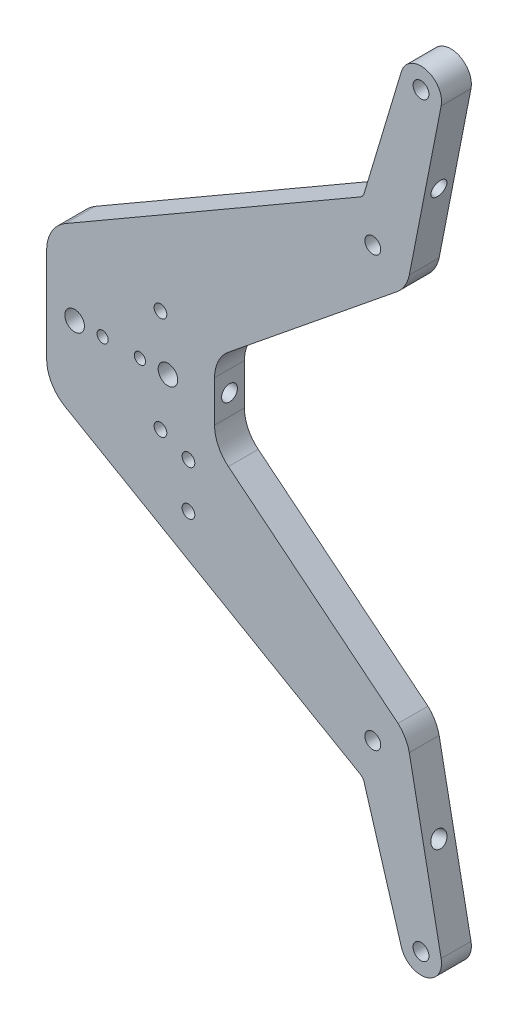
ISO-10303-21;
HEADER;
FILE_DESCRIPTION(('STEP AP214'),'2;1');
FILE_NAME('part.step','',(''),(''),'','','');
FILE_SCHEMA(('AUTOMOTIVE_DESIGN { 1 0 10303 214 1 1 1 1 }'));
ENDSEC;
DATA;
#1=APPLICATION_CONTEXT('core data for automotive mechanical design processes');
#2=APPLICATION_PROTOCOL_DEFINITION('international standard','automotive_design',2000,#1);
#3=PRODUCT_CONTEXT('',#1,'mechanical');
#4=PRODUCT('Part','Part','',(#3));
#5=PRODUCT_RELATED_PRODUCT_CATEGORY('part','',(#4));
#6=PRODUCT_DEFINITION_FORMATION('','',#4);
#7=PRODUCT_DEFINITION_CONTEXT('part definition',#1,'design');
#8=PRODUCT_DEFINITION('design','',#6,#7);
#9=PRODUCT_DEFINITION_SHAPE('','',#8);
#10=(LENGTH_UNIT() NAMED_UNIT(*) SI_UNIT(.MILLI.,.METRE.));
#11=(NAMED_UNIT(*) PLANE_ANGLE_UNIT() SI_UNIT($,.RADIAN.));
#12=(NAMED_UNIT(*) SI_UNIT($,.STERADIAN.) SOLID_ANGLE_UNIT());
#13=UNCERTAINTY_MEASURE_WITH_UNIT(LENGTH_MEASURE(1.E-05),#10,'distance_accuracy_value','');
#14=(GEOMETRIC_REPRESENTATION_CONTEXT(3) GLOBAL_UNCERTAINTY_ASSIGNED_CONTEXT((#13)) GLOBAL_UNIT_ASSIGNED_CONTEXT((#10,
#11,#12)) REPRESENTATION_CONTEXT('',''));
#15=CARTESIAN_POINT('',(0.,0.,0.));
#16=DIRECTION('',(0.,0.,1.));
#17=DIRECTION('',(1.,0.,0.));
#18=AXIS2_PLACEMENT_3D('',#15,#16,#17);
#19=CARTESIAN_POINT('',(-142.5,25.24,16.));
#20=DIRECTION('',(0.,0.,-1.));
#21=DIRECTION('',(-1.,0.,0.));
#22=AXIS2_PLACEMENT_3D('',#19,#20,#21);
#23=CYLINDRICAL_SURFACE('',#22,20.);
#24=CARTESIAN_POINT('',(-142.5,25.24,0.));
#25=DIRECTION('',(0.,0.,1.));
#26=DIRECTION('',(1.,0.,0.));
#27=AXIS2_PLACEMENT_3D('',#24,#25,#26);
#28=CIRCLE('',#27,20.);
#29=CARTESIAN_POINT('',(-152.511514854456,42.5538548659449,0.));
#30=VERTEX_POINT('',#29);
#31=CARTESIAN_POINT('',(-162.5,25.24,0.));
#32=VERTEX_POINT('',#31);
#33=EDGE_CURVE('E210',#30,#32,#28,.T.);
#34=ORIENTED_EDGE('',*,*,#33,.T.);
#35=DIRECTION('',(0.,0.,-1.));
#36=VECTOR('',#35,1.);
#37=CARTESIAN_POINT('',(-162.5,25.24,16.));
#38=LINE('',#37,#36);
#39=CARTESIAN_POINT('',(-162.5,25.24,16.));
#40=VERTEX_POINT('',#39);
#41=EDGE_CURVE('E11',#40,#32,#38,.T.);
#42=ORIENTED_EDGE('',*,*,#41,.F.);
#43=CARTESIAN_POINT('',(-142.5,25.24,16.));
#44=DIRECTION('',(0.,0.,1.));
#45=DIRECTION('',(1.,0.,0.));
#46=AXIS2_PLACEMENT_3D('',#43,#44,#45);
#47=CIRCLE('',#46,20.);
#48=CARTESIAN_POINT('',(-152.511514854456,42.5538548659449,16.));
#49=VERTEX_POINT('',#48);
#50=EDGE_CURVE('E249',#49,#40,#47,.T.);
#51=ORIENTED_EDGE('',*,*,#50,.F.);
#52=DIRECTION('',(0.,0.,-1.));
#53=VECTOR('',#52,1.);
#54=CARTESIAN_POINT('',(-152.511514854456,42.5538548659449,16.));
#55=LINE('',#54,#53);
#56=EDGE_CURVE('E206',#49,#30,#55,.T.);
#57=ORIENTED_EDGE('',*,*,#56,.T.);
#58=EDGE_LOOP('',(#34,#42,#51,#57));
#59=FACE_BOUND('',#58,.T.);
#60=ADVANCED_FACE('F37',(#59),#23,.T.);
#61=CARTESIAN_POINT('',(-162.5,25.24,16.));
#62=DIRECTION('',(1.,0.,0.));
#63=DIRECTION('',(0.,1.,0.));
#64=AXIS2_PLACEMENT_3D('',#61,#62,#63);
#65=PLANE('',#64);
#66=DIRECTION('',(0.,-1.,0.));
#67=VECTOR('',#66,1.);
#68=CARTESIAN_POINT('',(-162.5,25.24,0.));
#69=LINE('',#68,#67);
#70=CARTESIAN_POINT('',(-162.5,-25.24,0.));
#71=VERTEX_POINT('',#70);
#72=EDGE_CURVE('E213',#32,#71,#69,.T.);
#73=ORIENTED_EDGE('',*,*,#72,.T.);
#74=DIRECTION('',(0.,0.,-1.));
#75=VECTOR('',#74,1.);
#76=CARTESIAN_POINT('',(-162.5,-25.24,16.));
#77=LINE('',#76,#75);
#78=CARTESIAN_POINT('',(-162.5,-25.24,16.));
#79=VERTEX_POINT('',#78);
#80=EDGE_CURVE('E46',#79,#71,#77,.T.);
#81=ORIENTED_EDGE('',*,*,#80,.F.);
#82=DIRECTION('',(0.,-1.,0.));
#83=VECTOR('',#82,1.);
#84=CARTESIAN_POINT('',(-162.5,25.24,16.));
#85=LINE('',#84,#83);
#86=EDGE_CURVE('E135',#40,#79,#85,.T.);
#87=ORIENTED_EDGE('',*,*,#86,.F.);
#88=ORIENTED_EDGE('',*,*,#41,.T.);
#89=EDGE_LOOP('',(#73,#81,#87,#88));
#90=FACE_BOUND('',#89,.T.);
#91=ADVANCED_FACE('F374',(#90),#65,.F.);
#92=CARTESIAN_POINT('',(-142.5,-25.24,16.));
#93=DIRECTION('',(0.,0.,-1.));
#94=DIRECTION('',(-1.,0.,0.));
#95=AXIS2_PLACEMENT_3D('',#92,#93,#94);
#96=CYLINDRICAL_SURFACE('',#95,20.);
#97=CARTESIAN_POINT('',(-142.5,-25.24,0.));
#98=DIRECTION('',(0.,0.,1.));
#99=DIRECTION('',(-1.,0.,0.));
#100=AXIS2_PLACEMENT_3D('',#97,#98,#99);
#101=CIRCLE('',#100,20.);
#102=CARTESIAN_POINT('',(-152.511514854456,-42.5538548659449,0.));
#103=VERTEX_POINT('',#102);
#104=EDGE_CURVE('E216',#71,#103,#101,.T.);
#105=ORIENTED_EDGE('',*,*,#104,.T.);
#106=DIRECTION('',(0.,0.,-1.));
#107=VECTOR('',#106,1.);
#108=CARTESIAN_POINT('',(-152.511514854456,-42.5538548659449,16.));
#109=LINE('',#108,#107);
#110=CARTESIAN_POINT('',(-152.511514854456,-42.5538548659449,16.));
#111=VERTEX_POINT('',#110);
#112=EDGE_CURVE('E292',#111,#103,#109,.T.);
#113=ORIENTED_EDGE('',*,*,#112,.F.);
#114=CARTESIAN_POINT('',(-142.5,-25.24,16.));
#115=DIRECTION('',(0.,0.,1.));
#116=DIRECTION('',(-1.,0.,0.));
#117=AXIS2_PLACEMENT_3D('',#114,#115,#116);
#118=CIRCLE('',#117,20.);
#119=EDGE_CURVE('E318',#79,#111,#118,.T.);
#120=ORIENTED_EDGE('',*,*,#119,.F.);
#121=ORIENTED_EDGE('',*,*,#80,.T.);
#122=EDGE_LOOP('',(#105,#113,#120,#121));
#123=FACE_BOUND('',#122,.T.);
#124=ADVANCED_FACE('F378',(#123),#96,.T.);
#125=CARTESIAN_POINT('',(5.57858623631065,-133.967431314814,16.));
#126=DIRECTION('',(0.500575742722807,0.865692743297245,0.));
#127=DIRECTION('',(-0.865692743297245,0.500575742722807,0.));
#128=AXIS2_PLACEMENT_3D('',#125,#126,#127);
#129=PLANE('',#128);
#130=DIRECTION('',(0.865692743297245,-0.500575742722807,0.));
#131=VECTOR('',#130,1.);
#132=CARTESIAN_POINT('',(5.57858623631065,-133.967431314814,0.));
#133=LINE('',#132,#131);
#134=CARTESIAN_POINT('',(5.57858623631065,-133.967431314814,0.));
#135=VERTEX_POINT('',#134);
#136=EDGE_CURVE('E218',#103,#135,#133,.T.);
#137=ORIENTED_EDGE('',*,*,#136,.T.);
#138=DIRECTION('',(0.,0.,-1.));
#139=VECTOR('',#138,1.);
#140=CARTESIAN_POINT('',(5.57858623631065,-133.967431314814,16.));
#141=LINE('',#140,#139);
#142=CARTESIAN_POINT('',(5.57858623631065,-133.967431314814,16.));
#143=VERTEX_POINT('',#142);
#144=EDGE_CURVE('E289',#143,#135,#141,.T.);
#145=ORIENTED_EDGE('',*,*,#144,.F.);
#146=DIRECTION('',(0.865692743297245,-0.500575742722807,0.));
#147=VECTOR('',#146,1.);
#148=CARTESIAN_POINT('',(5.57858623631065,-133.967431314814,16.));
#149=LINE('',#148,#147);
#150=EDGE_CURVE('E320',#111,#143,#149,.T.);
#151=ORIENTED_EDGE('',*,*,#150,.F.);
#152=ORIENTED_EDGE('',*,*,#112,.T.);
#153=EDGE_LOOP('',(#137,#145,#151,#152));
#154=FACE_BOUND('',#153,.T.);
#155=ADVANCED_FACE('F382',(#154),#129,.F.);
#156=CARTESIAN_POINT('',(3.32999999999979,-137.856123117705,16.));
#157=DIRECTION('',(0.,0.,-1.));
#158=DIRECTION('',(-1.,0.,0.));
#159=AXIS2_PLACEMENT_3D('',#156,#157,#158);
#160=CYLINDRICAL_SURFACE('',#159,4.49200000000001);
#161=CARTESIAN_POINT('',(3.32999999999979,-137.856123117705,0.));
#162=DIRECTION('',(0.,0.,-1.));
#163=DIRECTION('',(1.,0.,0.));
#164=AXIS2_PLACEMENT_3D('',#161,#162,#163);
#165=CIRCLE('',#164,4.49200000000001);
#166=CARTESIAN_POINT('',(7.63274712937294,-136.565994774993,0.));
#167=VERTEX_POINT('',#166);
#168=EDGE_CURVE('E220',#135,#167,#165,.T.);
#169=ORIENTED_EDGE('',*,*,#168,.T.);
#170=DIRECTION('',(0.,0.,-1.));
#171=VECTOR('',#170,1.);
#172=CARTESIAN_POINT('',(7.63274712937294,-136.565994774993,16.));
#173=LINE('',#172,#171);
#174=CARTESIAN_POINT('',(7.63274712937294,-136.565994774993,16.));
#175=VERTEX_POINT('',#174);
#176=EDGE_CURVE('E286',#175,#167,#173,.T.);
#177=ORIENTED_EDGE('',*,*,#176,.F.);
#178=CARTESIAN_POINT('',(3.32999999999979,-137.856123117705,16.));
#179=DIRECTION('',(0.,0.,-1.));
#180=DIRECTION('',(1.,0.,0.));
#181=AXIS2_PLACEMENT_3D('',#178,#179,#180);
#182=CIRCLE('',#181,4.49200000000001);
#183=EDGE_CURVE('E322',#143,#175,#182,.T.);
#184=ORIENTED_EDGE('',*,*,#183,.F.);
#185=ORIENTED_EDGE('',*,*,#144,.T.);
#186=EDGE_LOOP('',(#169,#177,#184,#185));
#187=FACE_BOUND('',#186,.T.);
#188=ADVANCED_FACE('F388',(#187),#160,.F.);
#189=CARTESIAN_POINT('',(27.5999589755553,-203.15926352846,16.));
#190=DIRECTION('',(0.957868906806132,0.287205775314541,0.));
#191=DIRECTION('',(-0.287205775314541,0.957868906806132,0.));
#192=AXIS2_PLACEMENT_3D('',#189,#190,#191);
#193=PLANE('',#192);
#194=CARTESIAN_POINT('',(14.2384799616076,-158.596979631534,8.));
#195=DIRECTION('',(-0.957868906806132,-0.287205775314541,0.));
#196=DIRECTION('',(0.287205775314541,-0.957868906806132,0.));
#197=AXIS2_PLACEMENT_3D('',#194,#195,#196);
#198=CIRCLE('',#197,4.24999999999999);
#199=CARTESIAN_POINT('',(15.4591045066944,-162.66792248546,8.));
#200=VERTEX_POINT('',#199);
#201=EDGE_CURVE('E458',#200,#200,#198,.T.);
#202=ORIENTED_EDGE('',*,*,#201,.F.);
#203=EDGE_LOOP('',(#202));
#204=FACE_BOUND('',#203,.T.);
#205=DIRECTION('',(0.287205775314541,-0.957868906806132,0.));
#206=VECTOR('',#205,1.);
#207=CARTESIAN_POINT('',(27.5999589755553,-203.15926352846,0.));
#208=LINE('',#207,#206);
#209=CARTESIAN_POINT('',(27.5999589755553,-203.15926352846,0.));
#210=VERTEX_POINT('',#209);
#211=EDGE_CURVE('E222',#167,#210,#208,.T.);
#212=ORIENTED_EDGE('',*,*,#211,.T.);
#213=DIRECTION('',(0.,0.,-1.));
#214=VECTOR('',#213,1.);
#215=CARTESIAN_POINT('',(27.5999589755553,-203.15926352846,16.));
#216=LINE('',#215,#214);
#217=CARTESIAN_POINT('',(27.5999589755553,-203.15926352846,16.));
#218=VERTEX_POINT('',#217);
#219=EDGE_CURVE('E283',#218,#210,#216,.T.);
#220=ORIENTED_EDGE('',*,*,#219,.F.);
#221=DIRECTION('',(0.287205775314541,-0.957868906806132,0.));
#222=VECTOR('',#221,1.);
#223=CARTESIAN_POINT('',(27.5999589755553,-203.15926352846,16.));
#224=LINE('',#223,#222);
#225=EDGE_CURVE('E324',#175,#218,#224,.T.);
#226=ORIENTED_EDGE('',*,*,#225,.F.);
#227=ORIENTED_EDGE('',*,*,#176,.T.);
#228=EDGE_LOOP('',(#212,#220,#226,#227));
#229=FACE_BOUND('',#228,.T.);
#230=ADVANCED_FACE('F392',(#204,#229),#193,.F.);
#231=CARTESIAN_POINT('',(38.1365169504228,-200.,16.));
#232=DIRECTION('',(0.,0.,-1.));
#233=DIRECTION('',(-1.,0.,0.));
#234=AXIS2_PLACEMENT_3D('',#231,#232,#233);
#235=CYLINDRICAL_SURFACE('',#234,11.0000000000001);
#236=CARTESIAN_POINT('',(38.1365169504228,-200.,0.));
#237=DIRECTION('',(0.,0.,1.));
#238=DIRECTION('',(-1.,0.,0.));
#239=AXIS2_PLACEMENT_3D('',#236,#237,#238);
#240=CIRCLE('',#239,11.0000000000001);
#241=CARTESIAN_POINT('',(48.9310782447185,-197.884002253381,0.));
#242=VERTEX_POINT('',#241);
#243=EDGE_CURVE('E224',#210,#242,#240,.T.);
#244=ORIENTED_EDGE('',*,*,#243,.T.);
#245=DIRECTION('',(0.,0.,-1.));
#246=VECTOR('',#245,1.);
#247=CARTESIAN_POINT('',(48.9310782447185,-197.884002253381,16.));
#248=LINE('',#247,#246);
#249=CARTESIAN_POINT('',(48.9310782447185,-197.884002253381,16.));
#250=VERTEX_POINT('',#249);
#251=EDGE_CURVE('E280',#250,#242,#248,.T.);
#252=ORIENTED_EDGE('',*,*,#251,.F.);
#253=CARTESIAN_POINT('',(38.1365169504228,-200.,16.));
#254=DIRECTION('',(0.,0.,1.));
#255=DIRECTION('',(-1.,0.,0.));
#256=AXIS2_PLACEMENT_3D('',#253,#254,#255);
#257=CIRCLE('',#256,11.0000000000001);
#258=EDGE_CURVE('E326',#218,#250,#257,.T.);
#259=ORIENTED_EDGE('',*,*,#258,.F.);
#260=ORIENTED_EDGE('',*,*,#219,.T.);
#261=EDGE_LOOP('',(#244,#252,#259,#260));
#262=FACE_BOUND('',#261,.T.);
#263=ADVANCED_FACE('F396',(#262),#235,.T.);
#264=CARTESIAN_POINT('',(48.9310782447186,-197.884002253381,16.));
#265=DIRECTION('',(-0.981323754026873,-0.192363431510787,0.));
#266=DIRECTION('',(0.192363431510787,-0.981323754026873,0.));
#267=AXIS2_PLACEMENT_3D('',#264,#265,#266);
#268=PLANE('',#267);
#269=CARTESIAN_POINT('',(39.7314939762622,-150.953197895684,8.));
#270=DIRECTION('',(-0.981323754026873,-0.192363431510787,0.));
#271=DIRECTION('',(0.192363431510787,-0.981323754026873,0.));
#272=AXIS2_PLACEMENT_3D('',#269,#270,#271);
#273=ELLIPSE('',#272,4.27038081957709,4.24999999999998);
#274=CARTESIAN_POINT('',(40.5529590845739,-155.143824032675,8.));
#275=VERTEX_POINT('',#274);
#276=EDGE_CURVE('E455',#275,#275,#273,.T.);
#277=ORIENTED_EDGE('',*,*,#276,.T.);
#278=EDGE_LOOP('',(#277));
#279=FACE_BOUND('',#278,.T.);
#280=DIRECTION('',(-0.192363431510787,0.981323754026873,0.));
#281=VECTOR('',#280,1.);
#282=CARTESIAN_POINT('',(48.9310782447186,-197.884002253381,0.));
#283=LINE('',#282,#281);
#284=CARTESIAN_POINT('',(31.8674394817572,-110.835471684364,0.));
#285=VERTEX_POINT('',#284);
#286=EDGE_CURVE('E226',#242,#285,#283,.T.);
#287=ORIENTED_EDGE('',*,*,#286,.T.);
#288=DIRECTION('',(0.,0.,-1.));
#289=VECTOR('',#288,1.);
#290=CARTESIAN_POINT('',(31.8674394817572,-110.835471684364,16.));
#291=LINE('',#290,#289);
#292=CARTESIAN_POINT('',(31.8674394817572,-110.835471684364,16.));
#293=VERTEX_POINT('',#292);
#294=EDGE_CURVE('E277',#293,#285,#291,.T.);
#295=ORIENTED_EDGE('',*,*,#294,.F.);
#296=DIRECTION('',(-0.192363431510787,0.981323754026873,0.));
#297=VECTOR('',#296,1.);
#298=CARTESIAN_POINT('',(48.9310782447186,-197.884002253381,16.));
#299=LINE('',#298,#297);
#300=EDGE_CURVE('E328',#250,#293,#299,.T.);
#301=ORIENTED_EDGE('',*,*,#300,.F.);
#302=ORIENTED_EDGE('',*,*,#251,.T.);
#303=EDGE_LOOP('',(#287,#295,#301,#302));
#304=FACE_BOUND('',#303,.T.);
#305=ADVANCED_FACE('F400',(#279,#304),#268,.F.);
#306=CARTESIAN_POINT('',(12.3058264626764,-115.,16.));
#307=DIRECTION('',(0.,0.,-1.));
#308=DIRECTION('',(-1.,0.,0.));
#309=AXIS2_PLACEMENT_3D('',#306,#307,#308);
#310=CYLINDRICAL_SURFACE('',#309,20.);
#311=CARTESIAN_POINT('',(12.3058264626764,-115.,0.));
#312=DIRECTION('',(0.,0.,1.));
#313=DIRECTION('',(-1.,0.,0.));
#314=AXIS2_PLACEMENT_3D('',#311,#312,#313);
#315=CIRCLE('',#314,20.);
#316=CARTESIAN_POINT('',(25.82937699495,-100.265225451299,0.));
#317=VERTEX_POINT('',#316);
#318=EDGE_CURVE('E228',#285,#317,#315,.T.);
#319=ORIENTED_EDGE('',*,*,#318,.T.);
#320=DIRECTION('',(0.,0.,-1.));
#321=VECTOR('',#320,1.);
#322=CARTESIAN_POINT('',(25.82937699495,-100.265225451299,16.));
#323=LINE('',#322,#321);
#324=CARTESIAN_POINT('',(25.82937699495,-100.265225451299,16.));
#325=VERTEX_POINT('',#324);
#326=EDGE_CURVE('E274',#325,#317,#323,.T.);
#327=ORIENTED_EDGE('',*,*,#326,.F.);
#328=CARTESIAN_POINT('',(12.3058264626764,-115.,16.));
#329=DIRECTION('',(0.,0.,1.));
#330=DIRECTION('',(-1.,0.,0.));
#331=AXIS2_PLACEMENT_3D('',#328,#329,#330);
#332=CIRCLE('',#331,20.);
#333=EDGE_CURVE('E330',#293,#325,#332,.T.);
#334=ORIENTED_EDGE('',*,*,#333,.F.);
#335=ORIENTED_EDGE('',*,*,#294,.T.);
#336=EDGE_LOOP('',(#319,#327,#334,#335));
#337=FACE_BOUND('',#336,.T.);
#338=ADVANCED_FACE('F404',(#337),#310,.T.);
#339=CARTESIAN_POINT('',(-65.0967401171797,-26.5345466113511,16.));
#340=DIRECTION('',(-0.629837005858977,-0.776727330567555,0.));
#341=DIRECTION('',(0.776727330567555,-0.629837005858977,0.));
#342=AXIS2_PLACEMENT_3D('',#339,#340,#341);
#343=PLANE('',#342);
#344=DIRECTION('',(-0.776727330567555,0.629837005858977,0.));
#345=VECTOR('',#344,1.);
#346=CARTESIAN_POINT('',(-65.0967401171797,-26.5345466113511,0.));
#347=LINE('',#346,#345);
#348=CARTESIAN_POINT('',(-65.0967401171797,-26.5345466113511,0.));
#349=VERTEX_POINT('',#348);
#350=EDGE_CURVE('E230',#317,#349,#347,.T.);
#351=ORIENTED_EDGE('',*,*,#350,.T.);
#352=DIRECTION('',(0.,0.,-1.));
#353=VECTOR('',#352,1.);
#354=CARTESIAN_POINT('',(-65.0967401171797,-26.5345466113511,16.));
#355=LINE('',#354,#353);
#356=CARTESIAN_POINT('',(-65.0967401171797,-26.5345466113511,16.));
#357=VERTEX_POINT('',#356);
#358=EDGE_CURVE('E271',#357,#349,#355,.T.);
#359=ORIENTED_EDGE('',*,*,#358,.F.);
#360=DIRECTION('',(-0.776727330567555,0.629837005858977,0.));
#361=VECTOR('',#360,1.);
#362=CARTESIAN_POINT('',(-65.0967401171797,-26.5345466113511,16.));
#363=LINE('',#362,#361);
#364=EDGE_CURVE('E332',#325,#357,#363,.T.);
#365=ORIENTED_EDGE('',*,*,#364,.F.);
#366=ORIENTED_EDGE('',*,*,#326,.T.);
#367=EDGE_LOOP('',(#351,#359,#365,#366));
#368=FACE_BOUND('',#367,.T.);
#369=ADVANCED_FACE('F408',(#368),#343,.F.);
#370=CARTESIAN_POINT('',(-52.5000000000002,-11.,16.));
#371=DIRECTION('',(0.,0.,-1.));
#372=DIRECTION('',(-1.,0.,0.));
#373=AXIS2_PLACEMENT_3D('',#370,#371,#372);
#374=CYLINDRICAL_SURFACE('',#373,20.);
#375=CARTESIAN_POINT('',(-52.5000000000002,-11.,0.));
#376=DIRECTION('',(0.,0.,-1.));
#377=DIRECTION('',(-1.,0.,0.));
#378=AXIS2_PLACEMENT_3D('',#375,#376,#377);
#379=CIRCLE('',#378,20.);
#380=CARTESIAN_POINT('',(-72.5000000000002,-11.,0.));
#381=VERTEX_POINT('',#380);
#382=EDGE_CURVE('E232',#349,#381,#379,.T.);
#383=ORIENTED_EDGE('',*,*,#382,.T.);
#384=DIRECTION('',(0.,0.,-1.));
#385=VECTOR('',#384,1.);
#386=CARTESIAN_POINT('',(-72.5000000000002,-11.,16.));
#387=LINE('',#386,#385);
#388=CARTESIAN_POINT('',(-72.5000000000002,-11.,16.));
#389=VERTEX_POINT('',#388);
#390=EDGE_CURVE('E268',#389,#381,#387,.T.);
#391=ORIENTED_EDGE('',*,*,#390,.F.);
#392=CARTESIAN_POINT('',(-52.5000000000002,-11.,16.));
#393=DIRECTION('',(0.,0.,-1.));
#394=DIRECTION('',(-1.,0.,0.));
#395=AXIS2_PLACEMENT_3D('',#392,#393,#394);
#396=CIRCLE('',#395,20.);
#397=EDGE_CURVE('E334',#357,#389,#396,.T.);
#398=ORIENTED_EDGE('',*,*,#397,.F.);
#399=ORIENTED_EDGE('',*,*,#358,.T.);
#400=EDGE_LOOP('',(#383,#391,#398,#399));
#401=FACE_BOUND('',#400,.T.);
#402=ADVANCED_FACE('F412',(#401),#374,.F.);
#403=CARTESIAN_POINT('',(-72.5,11.,16.));
#404=DIRECTION('',(-1.,0.,0.));
#405=DIRECTION('',(0.,-1.,0.));
#406=AXIS2_PLACEMENT_3D('',#403,#404,#405);
#407=PLANE('',#406);
#408=CARTESIAN_POINT('',(-72.5000000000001,7.31737902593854E-13,8.));
#409=DIRECTION('',(1.,0.,0.));
#410=DIRECTION('',(0.,0.,-1.));
#411=AXIS2_PLACEMENT_3D('',#408,#409,#410);
#412=CIRCLE('',#411,4.24999999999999);
#413=CARTESIAN_POINT('',(-72.5000000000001,7.31737902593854E-13,3.75000000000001));
#414=VERTEX_POINT('',#413);
#415=EDGE_CURVE('E504',#414,#414,#412,.T.);
#416=ORIENTED_EDGE('',*,*,#415,.F.);
#417=EDGE_LOOP('',(#416));
#418=FACE_BOUND('',#417,.T.);
#419=DIRECTION('',(0.,1.,0.));
#420=VECTOR('',#419,1.);
#421=CARTESIAN_POINT('',(-72.5,11.,0.));
#422=LINE('',#421,#420);
#423=CARTESIAN_POINT('',(-72.5,11.,0.));
#424=VERTEX_POINT('',#423);
#425=EDGE_CURVE('E234',#381,#424,#422,.T.);
#426=ORIENTED_EDGE('',*,*,#425,.T.);
#427=DIRECTION('',(0.,0.,-1.));
#428=VECTOR('',#427,1.);
#429=CARTESIAN_POINT('',(-72.5,11.,16.));
#430=LINE('',#429,#428);
#431=CARTESIAN_POINT('',(-72.5,11.,16.));
#432=VERTEX_POINT('',#431);
#433=EDGE_CURVE('E265',#432,#424,#430,.T.);
#434=ORIENTED_EDGE('',*,*,#433,.F.);
#435=DIRECTION('',(0.,1.,0.));
#436=VECTOR('',#435,1.);
#437=CARTESIAN_POINT('',(-72.5,11.,16.));
#438=LINE('',#437,#436);
#439=EDGE_CURVE('E336',#389,#432,#438,.T.);
#440=ORIENTED_EDGE('',*,*,#439,.F.);
#441=ORIENTED_EDGE('',*,*,#390,.T.);
#442=EDGE_LOOP('',(#426,#434,#440,#441));
#443=FACE_BOUND('',#442,.T.);
#444=ADVANCED_FACE('F416',(#418,#443),#407,.F.);
#445=CARTESIAN_POINT('',(-52.5,11.,16.));
#446=DIRECTION('',(0.,0.,-1.));
#447=DIRECTION('',(-1.,0.,0.));
#448=AXIS2_PLACEMENT_3D('',#445,#446,#447);
#449=CYLINDRICAL_SURFACE('',#448,20.);
#450=CARTESIAN_POINT('',(-52.5,11.,0.));
#451=DIRECTION('',(0.,0.,-1.));
#452=DIRECTION('',(1.,0.,0.));
#453=AXIS2_PLACEMENT_3D('',#450,#451,#452);
#454=CIRCLE('',#453,20.);
#455=CARTESIAN_POINT('',(-65.0967401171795,26.5345466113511,0.));
#456=VERTEX_POINT('',#455);
#457=EDGE_CURVE('E236',#424,#456,#454,.T.);
#458=ORIENTED_EDGE('',*,*,#457,.T.);
#459=DIRECTION('',(0.,0.,-1.));
#460=VECTOR('',#459,1.);
#461=CARTESIAN_POINT('',(-65.0967401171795,26.5345466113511,16.));
#462=LINE('',#461,#460);
#463=CARTESIAN_POINT('',(-65.0967401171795,26.5345466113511,16.));
#464=VERTEX_POINT('',#463);
#465=EDGE_CURVE('E262',#464,#456,#462,.T.);
#466=ORIENTED_EDGE('',*,*,#465,.F.);
#467=CARTESIAN_POINT('',(-52.5,11.,16.));
#468=DIRECTION('',(0.,0.,-1.));
#469=DIRECTION('',(1.,0.,0.));
#470=AXIS2_PLACEMENT_3D('',#467,#468,#469);
#471=CIRCLE('',#470,20.);
#472=EDGE_CURVE('E338',#432,#464,#471,.T.);
#473=ORIENTED_EDGE('',*,*,#472,.F.);
#474=ORIENTED_EDGE('',*,*,#433,.T.);
#475=EDGE_LOOP('',(#458,#466,#473,#474));
#476=FACE_BOUND('',#475,.T.);
#477=ADVANCED_FACE('F420',(#476),#449,.F.);
#478=CARTESIAN_POINT('',(-65.0967401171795,26.5345466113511,16.));
#479=DIRECTION('',(-0.629837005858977,0.776727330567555,0.));
#480=DIRECTION('',(-0.776727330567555,-0.629837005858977,0.));
#481=AXIS2_PLACEMENT_3D('',#478,#479,#480);
#482=PLANE('',#481);
#483=DIRECTION('',(0.776727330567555,0.629837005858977,0.));
#484=VECTOR('',#483,1.);
#485=CARTESIAN_POINT('',(-65.0967401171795,26.5345466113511,0.));
#486=LINE('',#485,#484);
#487=CARTESIAN_POINT('',(25.8293769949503,100.265225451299,0.));
#488=VERTEX_POINT('',#487);
#489=EDGE_CURVE('E238',#456,#488,#486,.T.);
#490=ORIENTED_EDGE('',*,*,#489,.T.);
#491=DIRECTION('',(0.,0.,-1.));
#492=VECTOR('',#491,1.);
#493=CARTESIAN_POINT('',(25.8293769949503,100.265225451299,16.));
#494=LINE('',#493,#492);
#495=CARTESIAN_POINT('',(25.8293769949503,100.265225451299,16.));
#496=VERTEX_POINT('',#495);
#497=EDGE_CURVE('E259',#496,#488,#494,.T.);
#498=ORIENTED_EDGE('',*,*,#497,.F.);
#499=DIRECTION('',(0.776727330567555,0.629837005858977,0.));
#500=VECTOR('',#499,1.);
#501=CARTESIAN_POINT('',(-65.0967401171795,26.5345466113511,16.));
#502=LINE('',#501,#500);
#503=EDGE_CURVE('E340',#464,#496,#502,.T.);
#504=ORIENTED_EDGE('',*,*,#503,.F.);
#505=ORIENTED_EDGE('',*,*,#465,.T.);
#506=EDGE_LOOP('',(#490,#498,#504,#505));
#507=FACE_BOUND('',#506,.T.);
#508=ADVANCED_FACE('F424',(#507),#482,.F.);
#509=CARTESIAN_POINT('',(12.3058264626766,115.,16.));
#510=DIRECTION('',(0.,0.,-1.));
#511=DIRECTION('',(-1.,0.,0.));
#512=AXIS2_PLACEMENT_3D('',#509,#510,#511);
#513=CYLINDRICAL_SURFACE('',#512,20.);
#514=CARTESIAN_POINT('',(12.3058264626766,115.,0.));
#515=DIRECTION('',(0.,0.,1.));
#516=DIRECTION('',(1.,0.,0.));
#517=AXIS2_PLACEMENT_3D('',#514,#515,#516);
#518=CIRCLE('',#517,20.);
#519=CARTESIAN_POINT('',(31.8674394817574,110.835471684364,0.));
#520=VERTEX_POINT('',#519);
#521=EDGE_CURVE('E240',#488,#520,#518,.T.);
#522=ORIENTED_EDGE('',*,*,#521,.T.);
#523=DIRECTION('',(0.,0.,-1.));
#524=VECTOR('',#523,1.);
#525=CARTESIAN_POINT('',(31.8674394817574,110.835471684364,16.));
#526=LINE('',#525,#524);
#527=CARTESIAN_POINT('',(31.8674394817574,110.835471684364,16.));
#528=VERTEX_POINT('',#527);
#529=EDGE_CURVE('E256',#528,#520,#526,.T.);
#530=ORIENTED_EDGE('',*,*,#529,.F.);
#531=CARTESIAN_POINT('',(12.3058264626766,115.,16.));
#532=DIRECTION('',(0.,0.,1.));
#533=DIRECTION('',(1.,0.,0.));
#534=AXIS2_PLACEMENT_3D('',#531,#532,#533);
#535=CIRCLE('',#534,20.);
#536=EDGE_CURVE('E342',#496,#528,#535,.T.);
#537=ORIENTED_EDGE('',*,*,#536,.F.);
#538=ORIENTED_EDGE('',*,*,#497,.T.);
#539=EDGE_LOOP('',(#522,#530,#537,#538));
#540=FACE_BOUND('',#539,.T.);
#541=ADVANCED_FACE('F428',(#540),#513,.T.);
#542=CARTESIAN_POINT('',(48.9310782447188,197.884002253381,16.));
#543=DIRECTION('',(-0.981323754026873,0.192363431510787,0.));
#544=DIRECTION('',(-0.192363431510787,-0.981323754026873,0.));
#545=AXIS2_PLACEMENT_3D('',#542,#543,#544);
#546=PLANE('',#545);
#547=CARTESIAN_POINT('',(39.7314939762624,150.953197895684,8.));
#548=DIRECTION('',(-0.981323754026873,0.192363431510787,0.));
#549=DIRECTION('',(0.192363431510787,0.981323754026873,0.));
#550=AXIS2_PLACEMENT_3D('',#547,#548,#549);
#551=ELLIPSE('',#550,4.27038081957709,4.24999999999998);
#552=CARTESIAN_POINT('',(40.5529590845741,155.143824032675,8.));
#553=VERTEX_POINT('',#552);
#554=EDGE_CURVE('E307',#553,#553,#551,.T.);
#555=ORIENTED_EDGE('',*,*,#554,.T.);
#556=EDGE_LOOP('',(#555));
#557=FACE_BOUND('',#556,.T.);
#558=DIRECTION('',(0.192363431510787,0.981323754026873,0.));
#559=VECTOR('',#558,1.);
#560=CARTESIAN_POINT('',(48.9310782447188,197.884002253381,0.));
#561=LINE('',#560,#559);
#562=CARTESIAN_POINT('',(48.9310782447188,197.884002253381,0.));
#563=VERTEX_POINT('',#562);
#564=EDGE_CURVE('E242',#520,#563,#561,.T.);
#565=ORIENTED_EDGE('',*,*,#564,.T.);
#566=DIRECTION('',(0.,0.,-1.));
#567=VECTOR('',#566,1.);
#568=CARTESIAN_POINT('',(48.9310782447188,197.884002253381,16.));
#569=LINE('',#568,#567);
#570=CARTESIAN_POINT('',(48.9310782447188,197.884002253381,16.));
#571=VERTEX_POINT('',#570);
#572=EDGE_CURVE('E253',#571,#563,#569,.T.);
#573=ORIENTED_EDGE('',*,*,#572,.F.);
#574=DIRECTION('',(0.192363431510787,0.981323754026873,0.));
#575=VECTOR('',#574,1.);
#576=CARTESIAN_POINT('',(48.9310782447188,197.884002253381,16.));
#577=LINE('',#576,#575);
#578=EDGE_CURVE('E344',#528,#571,#577,.T.);
#579=ORIENTED_EDGE('',*,*,#578,.F.);
#580=ORIENTED_EDGE('',*,*,#529,.T.);
#581=EDGE_LOOP('',(#565,#573,#579,#580));
#582=FACE_BOUND('',#581,.T.);
#583=ADVANCED_FACE('F350',(#557,#582),#546,.F.);
#584=CARTESIAN_POINT('',(38.136516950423,200.,16.));
#585=DIRECTION('',(0.,0.,-1.));
#586=DIRECTION('',(-1.,0.,0.));
#587=AXIS2_PLACEMENT_3D('',#584,#585,#586);
#588=CYLINDRICAL_SURFACE('',#587,11.0000000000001);
#589=CARTESIAN_POINT('',(38.136516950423,200.,0.));
#590=DIRECTION('',(0.,0.,1.));
#591=DIRECTION('',(1.,0.,0.));
#592=AXIS2_PLACEMENT_3D('',#589,#590,#591);
#593=CIRCLE('',#592,11.0000000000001);
#594=CARTESIAN_POINT('',(27.5999589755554,203.15926352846,0.));
#595=VERTEX_POINT('',#594);
#596=EDGE_CURVE('E244',#563,#595,#593,.T.);
#597=ORIENTED_EDGE('',*,*,#596,.T.);
#598=DIRECTION('',(0.,0.,-1.));
#599=VECTOR('',#598,1.);
#600=CARTESIAN_POINT('',(27.5999589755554,203.15926352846,16.));
#601=LINE('',#600,#599);
#602=CARTESIAN_POINT('',(27.5999589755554,203.15926352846,16.));
#603=VERTEX_POINT('',#602);
#604=EDGE_CURVE('E201',#603,#595,#601,.T.);
#605=ORIENTED_EDGE('',*,*,#604,.F.);
#606=CARTESIAN_POINT('',(38.136516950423,200.,16.));
#607=DIRECTION('',(0.,0.,1.));
#608=DIRECTION('',(1.,0.,0.));
#609=AXIS2_PLACEMENT_3D('',#606,#607,#608);
#610=CIRCLE('',#609,11.0000000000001);
#611=EDGE_CURVE('E192',#571,#603,#610,.T.);
#612=ORIENTED_EDGE('',*,*,#611,.F.);
#613=ORIENTED_EDGE('',*,*,#572,.T.);
#614=EDGE_LOOP('',(#597,#605,#612,#613));
#615=FACE_BOUND('',#614,.T.);
#616=ADVANCED_FACE('F354',(#615),#588,.T.);
#617=CARTESIAN_POINT('',(27.5999589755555,203.15926352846,16.));
#618=DIRECTION('',(0.957868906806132,-0.287205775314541,0.));
#619=DIRECTION('',(0.287205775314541,0.957868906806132,0.));
#620=AXIS2_PLACEMENT_3D('',#617,#618,#619);
#621=PLANE('',#620);
#622=CARTESIAN_POINT('',(14.2384799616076,158.596979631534,8.));
#623=DIRECTION('',(-0.957868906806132,0.287205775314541,0.));
#624=DIRECTION('',(-0.287205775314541,-0.957868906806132,0.));
#625=AXIS2_PLACEMENT_3D('',#622,#623,#624);
#626=CIRCLE('',#625,4.24999999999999);
#627=CARTESIAN_POINT('',(13.0178554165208,154.526036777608,8.));
#628=VERTEX_POINT('',#627);
#629=EDGE_CURVE('E312',#628,#628,#626,.T.);
#630=ORIENTED_EDGE('',*,*,#629,.F.);
#631=EDGE_LOOP('',(#630));
#632=FACE_BOUND('',#631,.T.);
#633=DIRECTION('',(-0.287205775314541,-0.957868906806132,0.));
#634=VECTOR('',#633,1.);
#635=CARTESIAN_POINT('',(27.5999589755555,203.15926352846,0.));
#636=LINE('',#635,#634);
#637=CARTESIAN_POINT('',(7.63274712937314,136.565994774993,0.));
#638=VERTEX_POINT('',#637);
#639=EDGE_CURVE('E200',#595,#638,#636,.T.);
#640=ORIENTED_EDGE('',*,*,#639,.T.);
#641=DIRECTION('',(0.,0.,-1.));
#642=VECTOR('',#641,1.);
#643=CARTESIAN_POINT('',(7.63274712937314,136.565994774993,16.));
#644=LINE('',#643,#642);
#645=CARTESIAN_POINT('',(7.63274712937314,136.565994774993,16.));
#646=VERTEX_POINT('',#645);
#647=EDGE_CURVE('E197',#646,#638,#644,.T.);
#648=ORIENTED_EDGE('',*,*,#647,.F.);
#649=DIRECTION('',(-0.287205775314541,-0.957868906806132,0.));
#650=VECTOR('',#649,1.);
#651=CARTESIAN_POINT('',(27.5999589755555,203.15926352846,16.));
#652=LINE('',#651,#650);
#653=EDGE_CURVE('E186',#603,#646,#652,.T.);
#654=ORIENTED_EDGE('',*,*,#653,.F.);
#655=ORIENTED_EDGE('',*,*,#604,.T.);
#656=EDGE_LOOP('',(#640,#648,#654,#655));
#657=FACE_BOUND('',#656,.T.);
#658=ADVANCED_FACE('F198',(#632,#657),#621,.F.);
#659=CARTESIAN_POINT('',(3.33000000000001,137.856123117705,16.));
#660=DIRECTION('',(0.,0.,-1.));
#661=DIRECTION('',(-1.,0.,0.));
#662=AXIS2_PLACEMENT_3D('',#659,#660,#661);
#663=CYLINDRICAL_SURFACE('',#662,4.49200000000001);
#664=CARTESIAN_POINT('',(3.33000000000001,137.856123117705,0.));
#665=DIRECTION('',(0.,0.,-1.));
#666=DIRECTION('',(-1.,0.,0.));
#667=AXIS2_PLACEMENT_3D('',#664,#665,#666);
#668=CIRCLE('',#667,4.49200000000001);
#669=CARTESIAN_POINT('',(5.57858623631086,133.967431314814,0.));
#670=VERTEX_POINT('',#669);
#671=EDGE_CURVE('E121',#638,#670,#668,.T.);
#672=ORIENTED_EDGE('',*,*,#671,.T.);
#673=DIRECTION('',(0.,0.,-1.));
#674=VECTOR('',#673,1.);
#675=CARTESIAN_POINT('',(5.57858623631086,133.967431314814,16.));
#676=LINE('',#675,#674);
#677=CARTESIAN_POINT('',(5.57858623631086,133.967431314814,16.));
#678=VERTEX_POINT('',#677);
#679=EDGE_CURVE('E202',#678,#670,#676,.T.);
#680=ORIENTED_EDGE('',*,*,#679,.F.);
#681=CARTESIAN_POINT('',(3.33000000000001,137.856123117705,16.));
#682=DIRECTION('',(0.,0.,-1.));
#683=DIRECTION('',(-1.,0.,0.));
#684=AXIS2_PLACEMENT_3D('',#681,#682,#683);
#685=CIRCLE('',#684,4.49200000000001);
#686=EDGE_CURVE('E190',#646,#678,#685,.T.);
#687=ORIENTED_EDGE('',*,*,#686,.F.);
#688=ORIENTED_EDGE('',*,*,#647,.T.);
#689=EDGE_LOOP('',(#672,#680,#687,#688));
#690=FACE_BOUND('',#689,.T.);
#691=ADVANCED_FACE('F204',(#690),#663,.F.);
#692=CARTESIAN_POINT('',(5.57858623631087,133.967431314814,16.));
#693=DIRECTION('',(0.500575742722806,-0.865692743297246,0.));
#694=DIRECTION('',(0.865692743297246,0.500575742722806,0.));
#695=AXIS2_PLACEMENT_3D('',#692,#693,#694);
#696=PLANE('',#695);
#697=DIRECTION('',(-0.865692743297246,-0.500575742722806,0.));
#698=VECTOR('',#697,1.);
#699=CARTESIAN_POINT('',(5.57858623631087,133.967431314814,0.));
#700=LINE('',#699,#698);
#701=EDGE_CURVE('E127',#670,#30,#700,.T.);
#702=ORIENTED_EDGE('',*,*,#701,.T.);
#703=ORIENTED_EDGE('',*,*,#56,.F.);
#704=DIRECTION('',(-0.865692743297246,-0.500575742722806,0.));
#705=VECTOR('',#704,1.);
#706=CARTESIAN_POINT('',(5.57858623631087,133.967431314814,16.));
#707=LINE('',#706,#705);
#708=EDGE_CURVE('E55',#678,#49,#707,.T.);
#709=ORIENTED_EDGE('',*,*,#708,.F.);
#710=ORIENTED_EDGE('',*,*,#679,.T.);
#711=EDGE_LOOP('',(#702,#703,#709,#710));
#712=FACE_BOUND('',#711,.T.);
#713=ADVANCED_FACE('F362',(#712),#696,.F.);
#714=CARTESIAN_POINT('',(-142.5,25.24,16.));
#715=DIRECTION('',(0.,0.,1.));
#716=DIRECTION('',(1.,0.,0.));
#717=AXIS2_PLACEMENT_3D('',#714,#715,#716);
#718=PLANE('',#717);
#719=CARTESIAN_POINT('',(-132.5,0.,16.));
#720=DIRECTION('',(0.,0.,1.));
#721=DIRECTION('',(1.,0.,0.));
#722=AXIS2_PLACEMENT_3D('',#719,#720,#721);
#723=CIRCLE('',#722,3.);
#724=CARTESIAN_POINT('',(-129.5,0.,16.));
#725=VERTEX_POINT('',#724);
#726=EDGE_CURVE('E537',#725,#725,#723,.T.);
#727=ORIENTED_EDGE('',*,*,#726,.F.);
#728=EDGE_LOOP('',(#727));
#729=FACE_BOUND('',#728,.T.);
#730=CARTESIAN_POINT('',(-112.5,0.,16.));
#731=DIRECTION('',(0.,0.,1.));
#732=DIRECTION('',(1.,0.,0.));
#733=AXIS2_PLACEMENT_3D('',#730,#731,#732);
#734=CIRCLE('',#733,3.);
#735=CARTESIAN_POINT('',(-109.5,0.,16.));
#736=VERTEX_POINT('',#735);
#737=EDGE_CURVE('E539',#736,#736,#734,.T.);
#738=ORIENTED_EDGE('',*,*,#737,.F.);
#739=EDGE_LOOP('',(#738));
#740=FACE_BOUND('',#739,.T.);
#741=CARTESIAN_POINT('',(-101.5,27.5,16.));
#742=DIRECTION('',(0.,0.,1.));
#743=DIRECTION('',(1.,0.,0.));
#744=AXIS2_PLACEMENT_3D('',#741,#742,#743);
#745=CIRCLE('',#744,3.39999999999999);
#746=CARTESIAN_POINT('',(-98.1,27.5,16.));
#747=VERTEX_POINT('',#746);
#748=EDGE_CURVE('E494',#747,#747,#745,.T.);
#749=ORIENTED_EDGE('',*,*,#748,.F.);
#750=EDGE_LOOP('',(#749));
#751=FACE_BOUND('',#750,.T.);
#752=CARTESIAN_POINT('',(-101.5,-27.5,16.));
#753=DIRECTION('',(0.,0.,1.));
#754=DIRECTION('',(1.,0.,0.));
#755=AXIS2_PLACEMENT_3D('',#752,#753,#754);
#756=CIRCLE('',#755,3.39999999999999);
#757=CARTESIAN_POINT('',(-98.1,-27.5,16.));
#758=VERTEX_POINT('',#757);
#759=EDGE_CURVE('E488',#758,#758,#756,.T.);
#760=ORIENTED_EDGE('',*,*,#759,.F.);
#761=EDGE_LOOP('',(#760));
#762=FACE_BOUND('',#761,.T.);
#763=CARTESIAN_POINT('',(-86.5,-34.,16.));
#764=DIRECTION('',(0.,0.,1.));
#765=DIRECTION('',(1.,0.,0.));
#766=AXIS2_PLACEMENT_3D('',#763,#764,#765);
#767=CIRCLE('',#766,3.39999999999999);
#768=CARTESIAN_POINT('',(-83.1,-34.,16.));
#769=VERTEX_POINT('',#768);
#770=EDGE_CURVE('E482',#769,#769,#767,.T.);
#771=ORIENTED_EDGE('',*,*,#770,.F.);
#772=EDGE_LOOP('',(#771));
#773=FACE_BOUND('',#772,.T.);
#774=CARTESIAN_POINT('',(-86.5,-58.,16.));
#775=DIRECTION('',(0.,0.,1.));
#776=DIRECTION('',(1.,0.,0.));
#777=AXIS2_PLACEMENT_3D('',#774,#775,#776);
#778=CIRCLE('',#777,3.39999999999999);
#779=CARTESIAN_POINT('',(-83.1,-58.,16.));
#780=VERTEX_POINT('',#779);
#781=EDGE_CURVE('E476',#780,#780,#778,.T.);
#782=ORIENTED_EDGE('',*,*,#781,.F.);
#783=EDGE_LOOP('',(#782));
#784=FACE_BOUND('',#783,.T.);
#785=CARTESIAN_POINT('',(-147.5,0.,16.));
#786=DIRECTION('',(0.,0.,1.));
#787=DIRECTION('',(1.,0.,0.));
#788=AXIS2_PLACEMENT_3D('',#785,#786,#787);
#789=CIRCLE('',#788,5.24999999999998);
#790=CARTESIAN_POINT('',(-142.25,0.,16.));
#791=VERTEX_POINT('',#790);
#792=EDGE_CURVE('E470',#791,#791,#789,.T.);
#793=ORIENTED_EDGE('',*,*,#792,.F.);
#794=EDGE_LOOP('',(#793));
#795=FACE_BOUND('',#794,.T.);
#796=CARTESIAN_POINT('',(-97.5,0.,16.));
#797=DIRECTION('',(0.,0.,1.));
#798=DIRECTION('',(1.,0.,0.));
#799=AXIS2_PLACEMENT_3D('',#796,#797,#798);
#800=CIRCLE('',#799,5.24999999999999);
#801=CARTESIAN_POINT('',(-92.25,0.,16.));
#802=VERTEX_POINT('',#801);
#803=EDGE_CURVE('E464',#802,#802,#800,.T.);
#804=ORIENTED_EDGE('',*,*,#803,.F.);
#805=EDGE_LOOP('',(#804));
#806=FACE_BOUND('',#805,.T.);
#807=CARTESIAN_POINT('',(38.136516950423,-200.,16.));
#808=DIRECTION('',(0.,0.,1.));
#809=DIRECTION('',(1.,0.,0.));
#810=AXIS2_PLACEMENT_3D('',#807,#808,#809);
#811=CIRCLE('',#810,4.25);
#812=CARTESIAN_POINT('',(42.386516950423,-200.,16.));
#813=VERTEX_POINT('',#812);
#814=EDGE_CURVE('E452',#813,#813,#811,.T.);
#815=ORIENTED_EDGE('',*,*,#814,.F.);
#816=EDGE_LOOP('',(#815));
#817=FACE_BOUND('',#816,.T.);
#818=CARTESIAN_POINT('',(12.3058264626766,-115.,16.));
#819=DIRECTION('',(0.,0.,1.));
#820=DIRECTION('',(1.,0.,0.));
#821=AXIS2_PLACEMENT_3D('',#818,#819,#820);
#822=CIRCLE('',#821,4.25);
#823=CARTESIAN_POINT('',(16.5558264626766,-115.,16.));
#824=VERTEX_POINT('',#823);
#825=EDGE_CURVE('E447',#824,#824,#822,.T.);
#826=ORIENTED_EDGE('',*,*,#825,.F.);
#827=EDGE_LOOP('',(#826));
#828=FACE_BOUND('',#827,.T.);
#829=CARTESIAN_POINT('',(38.136516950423,200.,16.));
#830=DIRECTION('',(0.,0.,1.));
#831=DIRECTION('',(1.,0.,0.));
#832=AXIS2_PLACEMENT_3D('',#829,#830,#831);
#833=CIRCLE('',#832,4.25);
#834=CARTESIAN_POINT('',(42.386516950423,200.,16.));
#835=VERTEX_POINT('',#834);
#836=EDGE_CURVE('E301',#835,#835,#833,.T.);
#837=ORIENTED_EDGE('',*,*,#836,.F.);
#838=EDGE_LOOP('',(#837));
#839=FACE_BOUND('',#838,.T.);
#840=CARTESIAN_POINT('',(12.3058264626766,115.,16.));
#841=DIRECTION('',(0.,0.,1.));
#842=DIRECTION('',(1.,0.,0.));
#843=AXIS2_PLACEMENT_3D('',#840,#841,#842);
#844=CIRCLE('',#843,4.25);
#845=CARTESIAN_POINT('',(16.5558264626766,115.,16.));
#846=VERTEX_POINT('',#845);
#847=EDGE_CURVE('E298',#846,#846,#844,.T.);
#848=ORIENTED_EDGE('',*,*,#847,.F.);
#849=EDGE_LOOP('',(#848));
#850=FACE_BOUND('',#849,.T.);
#851=ORIENTED_EDGE('',*,*,#50,.T.);
#852=ORIENTED_EDGE('',*,*,#86,.T.);
#853=ORIENTED_EDGE('',*,*,#119,.T.);
#854=ORIENTED_EDGE('',*,*,#150,.T.);
#855=ORIENTED_EDGE('',*,*,#183,.T.);
#856=ORIENTED_EDGE('',*,*,#225,.T.);
#857=ORIENTED_EDGE('',*,*,#258,.T.);
#858=ORIENTED_EDGE('',*,*,#300,.T.);
#859=ORIENTED_EDGE('',*,*,#333,.T.);
#860=ORIENTED_EDGE('',*,*,#364,.T.);
#861=ORIENTED_EDGE('',*,*,#397,.T.);
#862=ORIENTED_EDGE('',*,*,#439,.T.);
#863=ORIENTED_EDGE('',*,*,#472,.T.);
#864=ORIENTED_EDGE('',*,*,#503,.T.);
#865=ORIENTED_EDGE('',*,*,#536,.T.);
#866=ORIENTED_EDGE('',*,*,#578,.T.);
#867=ORIENTED_EDGE('',*,*,#611,.T.);
#868=ORIENTED_EDGE('',*,*,#653,.T.);
#869=ORIENTED_EDGE('',*,*,#686,.T.);
#870=ORIENTED_EDGE('',*,*,#708,.T.);
#871=EDGE_LOOP('',(#851,#852,#853,#854,#855,#856,#857,#858,#859,#860,#861,#862,#863,#864,#865,
#866,#867,#868,#869,#870));
#872=FACE_BOUND('',#871,.T.);
#873=ADVANCED_FACE('F188',(#729,#740,#751,#762,#773,#784,#795,#806,#817,#828,#839,#850,#872),
#718,.T.);
#874=CARTESIAN_POINT('',(-142.5,25.24,0.));
#875=DIRECTION('',(0.,0.,1.));
#876=DIRECTION('',(1.,0.,0.));
#877=AXIS2_PLACEMENT_3D('',#874,#875,#876);
#878=PLANE('',#877);
#879=CARTESIAN_POINT('',(-101.5,27.5,0.));
#880=DIRECTION('',(0.,0.,1.));
#881=DIRECTION('',(1.,0.,0.));
#882=AXIS2_PLACEMENT_3D('',#879,#880,#881);
#883=CIRCLE('',#882,3.4);
#884=CARTESIAN_POINT('',(-98.1,27.5,0.));
#885=VERTEX_POINT('',#884);
#886=EDGE_CURVE('E491',#885,#885,#883,.T.);
#887=ORIENTED_EDGE('',*,*,#886,.T.);
#888=EDGE_LOOP('',(#887));
#889=FACE_BOUND('',#888,.T.);
#890=CARTESIAN_POINT('',(-101.5,-27.5,0.));
#891=DIRECTION('',(0.,0.,1.));
#892=DIRECTION('',(1.,0.,0.));
#893=AXIS2_PLACEMENT_3D('',#890,#891,#892);
#894=CIRCLE('',#893,3.4);
#895=CARTESIAN_POINT('',(-98.1,-27.5,0.));
#896=VERTEX_POINT('',#895);
#897=EDGE_CURVE('E485',#896,#896,#894,.T.);
#898=ORIENTED_EDGE('',*,*,#897,.T.);
#899=EDGE_LOOP('',(#898));
#900=FACE_BOUND('',#899,.T.);
#901=CARTESIAN_POINT('',(-86.5,-34.,0.));
#902=DIRECTION('',(0.,0.,1.));
#903=DIRECTION('',(1.,0.,0.));
#904=AXIS2_PLACEMENT_3D('',#901,#902,#903);
#905=CIRCLE('',#904,3.4);
#906=CARTESIAN_POINT('',(-83.1,-34.,0.));
#907=VERTEX_POINT('',#906);
#908=EDGE_CURVE('E479',#907,#907,#905,.T.);
#909=ORIENTED_EDGE('',*,*,#908,.T.);
#910=EDGE_LOOP('',(#909));
#911=FACE_BOUND('',#910,.T.);
#912=CARTESIAN_POINT('',(-86.5,-58.,0.));
#913=DIRECTION('',(0.,0.,1.));
#914=DIRECTION('',(1.,0.,0.));
#915=AXIS2_PLACEMENT_3D('',#912,#913,#914);
#916=CIRCLE('',#915,3.4);
#917=CARTESIAN_POINT('',(-83.1,-58.,0.));
#918=VERTEX_POINT('',#917);
#919=EDGE_CURVE('E473',#918,#918,#916,.T.);
#920=ORIENTED_EDGE('',*,*,#919,.T.);
#921=EDGE_LOOP('',(#920));
#922=FACE_BOUND('',#921,.T.);
#923=CARTESIAN_POINT('',(-147.5,0.,0.));
#924=DIRECTION('',(0.,0.,1.));
#925=DIRECTION('',(1.,0.,0.));
#926=AXIS2_PLACEMENT_3D('',#923,#924,#925);
#927=CIRCLE('',#926,5.25);
#928=CARTESIAN_POINT('',(-142.25,0.,0.));
#929=VERTEX_POINT('',#928);
#930=EDGE_CURVE('E467',#929,#929,#927,.T.);
#931=ORIENTED_EDGE('',*,*,#930,.T.);
#932=EDGE_LOOP('',(#931));
#933=FACE_BOUND('',#932,.T.);
#934=CARTESIAN_POINT('',(-97.5,0.,0.));
#935=DIRECTION('',(0.,0.,1.));
#936=DIRECTION('',(1.,0.,0.));
#937=AXIS2_PLACEMENT_3D('',#934,#935,#936);
#938=CIRCLE('',#937,5.24999999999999);
#939=CARTESIAN_POINT('',(-92.25,0.,0.));
#940=VERTEX_POINT('',#939);
#941=EDGE_CURVE('E461',#940,#940,#938,.T.);
#942=ORIENTED_EDGE('',*,*,#941,.T.);
#943=EDGE_LOOP('',(#942));
#944=FACE_BOUND('',#943,.T.);
#945=CARTESIAN_POINT('',(38.136516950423,-200.,0.));
#946=DIRECTION('',(0.,0.,1.));
#947=DIRECTION('',(1.,0.,0.));
#948=AXIS2_PLACEMENT_3D('',#945,#946,#947);
#949=CIRCLE('',#948,4.24999999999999);
#950=CARTESIAN_POINT('',(42.386516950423,-200.,0.));
#951=VERTEX_POINT('',#950);
#952=EDGE_CURVE('E40',#951,#951,#949,.T.);
#953=ORIENTED_EDGE('',*,*,#952,.T.);
#954=EDGE_LOOP('',(#953));
#955=FACE_BOUND('',#954,.T.);
#956=CARTESIAN_POINT('',(12.3058264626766,-115.,0.));
#957=DIRECTION('',(0.,0.,1.));
#958=DIRECTION('',(1.,0.,0.));
#959=AXIS2_PLACEMENT_3D('',#956,#957,#958);
#960=CIRCLE('',#959,4.24999999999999);
#961=CARTESIAN_POINT('',(16.5558264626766,-115.,0.));
#962=VERTEX_POINT('',#961);
#963=EDGE_CURVE('E445',#962,#962,#960,.T.);
#964=ORIENTED_EDGE('',*,*,#963,.T.);
#965=EDGE_LOOP('',(#964));
#966=FACE_BOUND('',#965,.T.);
#967=CARTESIAN_POINT('',(38.136516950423,200.,0.));
#968=DIRECTION('',(0.,0.,1.));
#969=DIRECTION('',(1.,0.,0.));
#970=AXIS2_PLACEMENT_3D('',#967,#968,#969);
#971=CIRCLE('',#970,4.24999999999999);
#972=CARTESIAN_POINT('',(42.386516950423,200.,0.));
#973=VERTEX_POINT('',#972);
#974=EDGE_CURVE('E299',#973,#973,#971,.T.);
#975=ORIENTED_EDGE('',*,*,#974,.T.);
#976=EDGE_LOOP('',(#975));
#977=FACE_BOUND('',#976,.T.);
#978=CARTESIAN_POINT('',(12.3058264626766,115.,0.));
#979=DIRECTION('',(0.,0.,1.));
#980=DIRECTION('',(1.,0.,0.));
#981=AXIS2_PLACEMENT_3D('',#978,#979,#980);
#982=CIRCLE('',#981,4.24999999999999);
#983=CARTESIAN_POINT('',(16.5558264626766,115.,0.));
#984=VERTEX_POINT('',#983);
#985=EDGE_CURVE('E214',#984,#984,#982,.T.);
#986=ORIENTED_EDGE('',*,*,#985,.T.);
#987=EDGE_LOOP('',(#986));
#988=FACE_BOUND('',#987,.T.);
#989=ORIENTED_EDGE('',*,*,#33,.F.);
#990=ORIENTED_EDGE('',*,*,#701,.F.);
#991=ORIENTED_EDGE('',*,*,#671,.F.);
#992=ORIENTED_EDGE('',*,*,#639,.F.);
#993=ORIENTED_EDGE('',*,*,#596,.F.);
#994=ORIENTED_EDGE('',*,*,#564,.F.);
#995=ORIENTED_EDGE('',*,*,#521,.F.);
#996=ORIENTED_EDGE('',*,*,#489,.F.);
#997=ORIENTED_EDGE('',*,*,#457,.F.);
#998=ORIENTED_EDGE('',*,*,#425,.F.);
#999=ORIENTED_EDGE('',*,*,#382,.F.);
#1000=ORIENTED_EDGE('',*,*,#350,.F.);
#1001=ORIENTED_EDGE('',*,*,#318,.F.);
#1002=ORIENTED_EDGE('',*,*,#286,.F.);
#1003=ORIENTED_EDGE('',*,*,#243,.F.);
#1004=ORIENTED_EDGE('',*,*,#211,.F.);
#1005=ORIENTED_EDGE('',*,*,#168,.F.);
#1006=ORIENTED_EDGE('',*,*,#136,.F.);
#1007=ORIENTED_EDGE('',*,*,#104,.F.);
#1008=ORIENTED_EDGE('',*,*,#72,.F.);
#1009=EDGE_LOOP('',(#989,#990,#991,#992,#993,#994,#995,#996,#997,#998,#999,#1000,#1001,#1002,
#1003,#1004,#1005,#1006,#1007,#1008));
#1010=FACE_BOUND('',#1009,.T.);
#1011=ADVANCED_FACE('F357',(#889,#900,#911,#922,#933,#944,#955,#966,#977,#988,#1010),#878,.F.);
#1012=CARTESIAN_POINT('',(12.3058264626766,115.,16.));
#1013=DIRECTION('',(0.,0.,1.));
#1014=DIRECTION('',(1.,0.,0.));
#1015=AXIS2_PLACEMENT_3D('',#1012,#1013,#1014);
#1016=CYLINDRICAL_SURFACE('',#1015,4.24999999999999);
#1017=ORIENTED_EDGE('',*,*,#847,.T.);
#1018=EDGE_LOOP('',(#1017));
#1019=FACE_BOUND('',#1018,.T.);
#1020=ORIENTED_EDGE('',*,*,#985,.F.);
#1021=EDGE_LOOP('',(#1020));
#1022=FACE_BOUND('',#1021,.T.);
#1023=ADVANCED_FACE('F612',(#1019,#1022),#1016,.F.);
#1024=CARTESIAN_POINT('',(38.136516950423,200.,16.));
#1025=DIRECTION('',(0.,0.,1.));
#1026=DIRECTION('',(1.,0.,0.));
#1027=AXIS2_PLACEMENT_3D('',#1024,#1025,#1026);
#1028=CYLINDRICAL_SURFACE('',#1027,4.24999999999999);
#1029=ORIENTED_EDGE('',*,*,#836,.T.);
#1030=EDGE_LOOP('',(#1029));
#1031=FACE_BOUND('',#1030,.T.);
#1032=ORIENTED_EDGE('',*,*,#974,.F.);
#1033=EDGE_LOOP('',(#1032));
#1034=FACE_BOUND('',#1033,.T.);
#1035=ADVANCED_FACE('F615',(#1031,#1034),#1028,.F.);
#1036=CARTESIAN_POINT('',(14.2384799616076,158.596979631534,8.));
#1037=DIRECTION('',(-0.957868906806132,0.287205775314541,0.));
#1038=DIRECTION('',(-0.287205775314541,-0.957868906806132,0.));
#1039=AXIS2_PLACEMENT_3D('',#1036,#1037,#1038);
#1040=CYLINDRICAL_SURFACE('',#1039,4.24999999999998);
#1041=ORIENTED_EDGE('',*,*,#629,.T.);
#1042=EDGE_LOOP('',(#1041));
#1043=FACE_BOUND('',#1042,.T.);
#1044=ORIENTED_EDGE('',*,*,#554,.F.);
#1045=EDGE_LOOP('',(#1044));
#1046=FACE_BOUND('',#1045,.T.);
#1047=ADVANCED_FACE('F627',(#1043,#1046),#1040,.F.);
#1048=CARTESIAN_POINT('',(12.3058264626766,-115.,16.));
#1049=DIRECTION('',(0.,0.,1.));
#1050=DIRECTION('',(1.,0.,0.));
#1051=AXIS2_PLACEMENT_3D('',#1048,#1049,#1050);
#1052=CYLINDRICAL_SURFACE('',#1051,4.24999999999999);
#1053=ORIENTED_EDGE('',*,*,#825,.T.);
#1054=EDGE_LOOP('',(#1053));
#1055=FACE_BOUND('',#1054,.T.);
#1056=ORIENTED_EDGE('',*,*,#963,.F.);
#1057=EDGE_LOOP('',(#1056));
#1058=FACE_BOUND('',#1057,.T.);
#1059=ADVANCED_FACE('F630',(#1055,#1058),#1052,.F.);
#1060=CARTESIAN_POINT('',(38.136516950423,-200.,16.));
#1061=DIRECTION('',(0.,0.,1.));
#1062=DIRECTION('',(1.,0.,0.));
#1063=AXIS2_PLACEMENT_3D('',#1060,#1061,#1062);
#1064=CYLINDRICAL_SURFACE('',#1063,4.24999999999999);
#1065=ORIENTED_EDGE('',*,*,#814,.T.);
#1066=EDGE_LOOP('',(#1065));
#1067=FACE_BOUND('',#1066,.T.);
#1068=ORIENTED_EDGE('',*,*,#952,.F.);
#1069=EDGE_LOOP('',(#1068));
#1070=FACE_BOUND('',#1069,.T.);
#1071=ADVANCED_FACE('F633',(#1067,#1070),#1064,.F.);
#1072=CARTESIAN_POINT('',(14.2384799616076,-158.596979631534,8.));
#1073=DIRECTION('',(-0.957868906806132,-0.287205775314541,0.));
#1074=DIRECTION('',(0.287205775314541,-0.957868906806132,0.));
#1075=AXIS2_PLACEMENT_3D('',#1072,#1073,#1074);
#1076=CYLINDRICAL_SURFACE('',#1075,4.24999999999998);
#1077=ORIENTED_EDGE('',*,*,#201,.T.);
#1078=EDGE_LOOP('',(#1077));
#1079=FACE_BOUND('',#1078,.T.);
#1080=ORIENTED_EDGE('',*,*,#276,.F.);
#1081=EDGE_LOOP('',(#1080));
#1082=FACE_BOUND('',#1081,.T.);
#1083=ADVANCED_FACE('F637',(#1079,#1082),#1076,.F.);
#1084=CARTESIAN_POINT('',(-97.5,0.,16.));
#1085=DIRECTION('',(0.,0.,1.));
#1086=DIRECTION('',(1.,0.,0.));
#1087=AXIS2_PLACEMENT_3D('',#1084,#1085,#1086);
#1088=CYLINDRICAL_SURFACE('',#1087,5.24999999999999);
#1089=CARTESIAN_POINT('',(-92.25,0.,3.75000000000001));
#1090=CARTESIAN_POINT('',(-92.2499997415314,0.101753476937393,3.74999973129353));
#1091=CARTESIAN_POINT('',(-92.2529640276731,0.203503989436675,3.7536598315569));
#1092=CARTESIAN_POINT('',(-92.2647516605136,0.406180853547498,3.7682339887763));
#1093=CARTESIAN_POINT('',(-92.2735773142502,0.507106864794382,3.77915090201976));
#1094=CARTESIAN_POINT('',(-92.2968977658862,0.707393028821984,3.80806180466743));
#1095=CARTESIAN_POINT('',(-92.3113992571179,0.806751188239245,3.8260641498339));
#1096=CARTESIAN_POINT('',(-92.345754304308,1.00309067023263,3.86884870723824));
#1097=CARTESIAN_POINT('',(-92.3656102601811,1.10007090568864,3.89363395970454));
#1098=CARTESIAN_POINT('',(-92.4101111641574,1.29035334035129,3.94941364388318));
#1099=CARTESIAN_POINT('',(-92.4347230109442,1.38367588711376,3.98036520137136));
#1100=CARTESIAN_POINT('',(-92.4883543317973,1.56685453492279,4.04816252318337));
#1101=CARTESIAN_POINT('',(-92.5173753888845,1.65670937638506,4.08501040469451));
#1102=CARTESIAN_POINT('',(-92.6103093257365,1.9204384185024,4.20374853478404));
#1103=CARTESIAN_POINT('',(-92.6801323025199,2.08863979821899,4.29388194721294));
#1104=CARTESIAN_POINT('',(-92.8068752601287,2.35614931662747,4.46060428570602));
#1105=CARTESIAN_POINT('',(-92.8606971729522,2.46018490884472,4.53219067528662));
#1106=CARTESIAN_POINT('',(-92.9724033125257,2.66016208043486,4.68311723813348));
#1107=CARTESIAN_POINT('',(-93.0302875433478,2.75610365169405,4.76245741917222));
#1108=CARTESIAN_POINT('',(-93.1490326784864,2.94000101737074,4.92847039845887));
#1109=CARTESIAN_POINT('',(-93.2099017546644,3.02793276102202,5.01516386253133));
#1110=CARTESIAN_POINT('',(-93.333159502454,3.19542542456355,5.19520636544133));
#1111=CARTESIAN_POINT('',(-93.3955475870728,3.27498951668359,5.28855285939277));
#1112=CARTESIAN_POINT('',(-93.5215283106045,3.42697590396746,5.48328649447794));
#1113=CARTESIAN_POINT('',(-93.5851237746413,3.49925796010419,5.58478126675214));
#1114=CARTESIAN_POINT('',(-93.710859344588,3.63503414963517,5.79440970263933));
#1115=CARTESIAN_POINT('',(-93.7729989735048,3.69852543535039,5.90254550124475));
#1116=CARTESIAN_POINT('',(-93.8936321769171,3.81624012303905,6.12526383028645));
#1117=CARTESIAN_POINT('',(-93.9521350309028,3.87048778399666,6.23982840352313));
#1118=CARTESIAN_POINT('',(-94.063075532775,3.96932832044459,6.47577157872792));
#1119=CARTESIAN_POINT('',(-94.1155183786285,4.01392949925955,6.5971442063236));
#1120=CARTESIAN_POINT('',(-94.2175458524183,4.09791574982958,6.86351084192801));
#1121=CARTESIAN_POINT('',(-94.2658190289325,4.13581442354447,7.00949764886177));
#1122=CARTESIAN_POINT('',(-94.3445945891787,4.19624327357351,7.30918877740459));
#1123=CARTESIAN_POINT('',(-94.3751411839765,4.21881170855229,7.46287285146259));
#1124=CARTESIAN_POINT('',(-94.4039651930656,4.23995125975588,7.69734506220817));
#1125=CARTESIAN_POINT('',(-94.410730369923,4.24487056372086,7.77659139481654));
#1126=CARTESIAN_POINT('',(-94.4181376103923,4.2502533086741,7.93553642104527));
#1127=CARTESIAN_POINT('',(-94.4187800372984,4.25071701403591,8.01523508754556));
#1128=CARTESIAN_POINT('',(-94.4138908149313,4.24716808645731,8.17436666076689));
#1129=CARTESIAN_POINT('',(-94.4083568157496,4.243153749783,8.25379945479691));
#1130=CARTESIAN_POINT('',(-94.3914080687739,4.23075234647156,8.41171949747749));
#1131=CARTESIAN_POINT('',(-94.3799902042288,4.22236296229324,8.49020622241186));
#1132=CARTESIAN_POINT('',(-94.3498805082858,4.19995762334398,8.65636813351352));
#1133=CARTESIAN_POINT('',(-94.3304025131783,4.18532513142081,8.74381723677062));
#1134=CARTESIAN_POINT('',(-94.2855802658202,4.15100044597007,8.91620561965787));
#1135=CARTESIAN_POINT('',(-94.2602316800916,4.13130451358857,9.00114299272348));
#1136=CARTESIAN_POINT('',(-94.1769499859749,4.06507504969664,9.25205041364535));
#1137=CARTESIAN_POINT('',(-94.1118426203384,4.01144262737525,9.4138136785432));
#1138=CARTESIAN_POINT('',(-93.9874357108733,3.90250248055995,9.68797046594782));
#1139=CARTESIAN_POINT('',(-93.9304786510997,3.85067115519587,9.80291049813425));
#1140=CARTESIAN_POINT('',(-93.8126282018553,3.73797179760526,10.026253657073));
#1141=CARTESIAN_POINT('',(-93.7517328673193,3.67709928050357,10.1346535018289));
#1142=CARTESIAN_POINT('',(-93.6280243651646,3.54660476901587,10.345089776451));
#1143=CARTESIAN_POINT('',(-93.5652089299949,3.47697210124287,10.4471182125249));
#1144=CARTESIAN_POINT('',(-93.4394053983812,3.32918745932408,10.6446586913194));
#1145=CARTESIAN_POINT('',(-93.3764173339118,3.25103697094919,10.7401718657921));
#1146=CARTESIAN_POINT('',(-93.2496523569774,3.08357451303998,10.9275184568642));
#1147=CARTESIAN_POINT('',(-93.1859171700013,2.99398082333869,11.0191289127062));
#1148=CARTESIAN_POINT('',(-93.0612309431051,2.80581088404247,11.1947600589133));
#1149=CARTESIAN_POINT('',(-93.0002803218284,2.70723329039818,11.2787796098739));
#1150=CARTESIAN_POINT('',(-92.8827094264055,2.50142528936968,11.4383534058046));
#1151=CARTESIAN_POINT('',(-92.8260798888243,2.39421446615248,11.513925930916));
#1152=CARTESIAN_POINT('',(-92.7184489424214,2.17131561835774,11.6558673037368));
#1153=CARTESIAN_POINT('',(-92.6674451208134,2.05563126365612,11.7222401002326));
#1154=CARTESIAN_POINT('',(-92.5515953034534,1.7635225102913,11.8716699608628));
#1155=CARTESIAN_POINT('',(-92.4904764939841,1.58269427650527,11.9492944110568));
#1156=CARTESIAN_POINT('',(-92.4128983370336,1.3013150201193,12.0470959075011));
#1157=CARTESIAN_POINT('',(-92.3893854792,1.20581117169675,12.0765948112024));
#1158=CARTESIAN_POINT('',(-92.3474938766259,1.01192521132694,12.1289914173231));
#1159=CARTESIAN_POINT('',(-92.3291126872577,0.9135444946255,12.151892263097));
#1160=CARTESIAN_POINT('',(-92.2977797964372,0.713920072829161,12.1908506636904));
#1161=CARTESIAN_POINT('',(-92.2848633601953,0.612662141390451,12.2068637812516));
#1162=CARTESIAN_POINT('',(-92.2649317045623,0.408717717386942,12.2315473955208));
#1163=CARTESIAN_POINT('',(-92.2579139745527,0.306031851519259,12.2402210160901));
#1164=CARTESIAN_POINT('',(-92.2499419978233,0.100063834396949,12.2500726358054));
#1165=CARTESIAN_POINT('',(-92.2489878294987,-0.00321832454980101,12.2512505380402));
#1166=CARTESIAN_POINT('',(-92.2531663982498,-0.209464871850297,12.2460882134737));
#1167=CARTESIAN_POINT('',(-92.258298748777,-0.312429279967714,12.2397484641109));
#1168=CARTESIAN_POINT('',(-92.2737834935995,-0.507805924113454,12.2205885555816));
#1169=CARTESIAN_POINT('',(-92.2836166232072,-0.60032343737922,12.2084127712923));
#1170=CARTESIAN_POINT('',(-92.3080066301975,-0.783762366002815,12.1781423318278));
#1171=CARTESIAN_POINT('',(-92.3225649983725,-0.87468326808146,12.1600458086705));
#1172=CARTESIAN_POINT('',(-92.3729404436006,-1.14413607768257,12.0972407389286));
#1173=CARTESIAN_POINT('',(-92.4154716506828,-1.31952370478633,12.0439998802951));
#1174=CARTESIAN_POINT('',(-92.5180745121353,-1.66654291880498,11.9142346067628));
#1175=CARTESIAN_POINT('',(-92.5789151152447,-1.83755102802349,11.8366814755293));
#1176=CARTESIAN_POINT('',(-92.7135153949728,-2.16408546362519,11.6624455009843));
#1177=CARTESIAN_POINT('',(-92.7872838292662,-2.31960118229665,11.565749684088));
#1178=CARTESIAN_POINT('',(-92.922346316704,-2.57336445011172,11.3848868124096));
#1179=CARTESIAN_POINT('',(-92.9814847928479,-2.67559252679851,11.3045975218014));
#1180=CARTESIAN_POINT('',(-93.1031674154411,-2.87116993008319,11.1361653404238));
#1181=CARTESIAN_POINT('',(-93.1657115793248,-2.96451921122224,11.0480224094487));
#1182=CARTESIAN_POINT('',(-93.2929214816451,-3.14244819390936,10.8642486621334));
#1183=CARTESIAN_POINT('',(-93.3575916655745,-3.22700774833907,10.7686014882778));
#1184=CARTESIAN_POINT('',(-93.4873972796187,-3.38705263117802,10.5703314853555));
#1185=CARTESIAN_POINT('',(-93.5525325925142,-3.46254016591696,10.4677103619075));
#1186=CARTESIAN_POINT('',(-93.6714341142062,-3.59320437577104,10.2722126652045));
#1187=CARTESIAN_POINT('',(-93.7253813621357,-3.64970976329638,10.180331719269));
#1188=CARTESIAN_POINT('',(-93.831171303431,-3.75603744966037,9.99158728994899));
#1189=CARTESIAN_POINT('',(-93.8830137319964,-3.80585890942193,9.89472318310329));
#1190=CARTESIAN_POINT('',(-93.9829690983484,-3.89841257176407,9.69612644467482));
#1191=CARTESIAN_POINT('',(-94.031090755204,-3.94116163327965,9.59440615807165));
#1192=CARTESIAN_POINT('',(-94.1218601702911,-4.01923527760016,9.38587587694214));
#1193=CARTESIAN_POINT('',(-94.1645110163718,-4.0545640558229,9.27906880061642));
#1194=CARTESIAN_POINT('',(-94.2535403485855,-4.12640001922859,9.02807534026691));
#1195=CARTESIAN_POINT('',(-94.2973358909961,-4.16020704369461,8.88212225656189));
#1196=CARTESIAN_POINT('',(-94.3491435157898,-4.1994131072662,8.65816400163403));
#1197=CARTESIAN_POINT('',(-94.3640938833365,-4.21056130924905,8.58271744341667));
#1198=CARTESIAN_POINT('',(-94.3887766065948,-4.2288327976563,8.43050865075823));
#1199=CARTESIAN_POINT('',(-94.398511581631,-4.23595810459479,8.35374709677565));
#1200=CARTESIAN_POINT('',(-94.4123593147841,-4.24606293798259,8.19881007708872));
#1201=CARTESIAN_POINT('',(-94.4164257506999,-4.24900831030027,8.12062819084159));
#1202=CARTESIAN_POINT('',(-94.4185774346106,-4.25056899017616,7.96414039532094));
#1203=CARTESIAN_POINT('',(-94.4166628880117,-4.24918444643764,7.88583449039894));
#1204=CARTESIAN_POINT('',(-94.4069472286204,-4.24211745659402,7.72972826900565));
#1205=CARTESIAN_POINT('',(-94.3991417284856,-4.2364318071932,7.65192837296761));
#1206=CARTESIAN_POINT('',(-94.3780369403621,-4.22090197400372,7.49748046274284));
#1207=CARTESIAN_POINT('',(-94.3647346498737,-4.2110555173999,7.42083310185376));
#1208=CARTESIAN_POINT('',(-94.3110945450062,-4.17080935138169,7.1628974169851));
#1209=CARTESIAN_POINT('',(-94.2589886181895,-4.1309404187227,6.98543886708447));
#1210=CARTESIAN_POINT('',(-94.1361135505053,-4.03149329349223,6.64292089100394));
#1211=CARTESIAN_POINT('',(-94.0652873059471,-3.97185465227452,6.47790142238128));
#1212=CARTESIAN_POINT('',(-93.9320551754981,-3.8520441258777,6.1996814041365));
#1213=CARTESIAN_POINT('',(-93.8718802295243,-3.79563084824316,6.08373778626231));
#1214=CARTESIAN_POINT('',(-93.7481773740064,-3.6734019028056,5.85873220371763));
#1215=CARTESIAN_POINT('',(-93.6846479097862,-3.60758185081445,5.74967348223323));
#1216=CARTESIAN_POINT('',(-93.5562631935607,-3.46677603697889,5.53827171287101));
#1217=CARTESIAN_POINT('',(-93.4914065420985,-3.39178013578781,5.43593628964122));
#1218=CARTESIAN_POINT('',(-93.362141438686,-3.2328194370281,5.23821349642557));
#1219=CARTESIAN_POINT('',(-93.2977329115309,-3.14885618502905,5.14282493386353));
#1220=CARTESIAN_POINT('',(-93.1693652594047,-2.96993396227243,4.9571398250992));
#1221=CARTESIAN_POINT('',(-93.1054518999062,-2.87476370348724,4.86701461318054));
#1222=CARTESIAN_POINT('',(-92.9811504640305,-2.67513202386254,4.69492221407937));
#1223=CARTESIAN_POINT('',(-92.9207629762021,-2.57066905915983,4.61295638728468));
#1224=CARTESIAN_POINT('',(-92.8051443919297,-2.35286686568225,4.4582057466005));
#1225=CARTESIAN_POINT('',(-92.7499018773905,-2.23954837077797,4.3854004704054));
#1226=CARTESIAN_POINT('',(-92.6459598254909,-2.00433281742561,4.2498542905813));
#1227=CARTESIAN_POINT('',(-92.5972567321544,-1.88244047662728,4.18710791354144));
#1228=CARTESIAN_POINT('',(-92.4908069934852,-1.58253130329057,4.05101891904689));
#1229=CARTESIAN_POINT('',(-92.4366753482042,-1.40081301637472,3.98273526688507));
#1230=CARTESIAN_POINT('',(-92.3698742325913,-1.11965616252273,3.89896815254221));
#1231=CARTESIAN_POINT('',(-92.350014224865,-1.02456717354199,3.87416484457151));
#1232=CARTESIAN_POINT('',(-92.3154268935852,-0.832013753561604,3.83107130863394));
#1233=CARTESIAN_POINT('',(-92.3006977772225,-0.734550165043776,3.81277880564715));
#1234=CARTESIAN_POINT('',(-92.2759091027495,-0.531513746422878,3.78203681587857));
#1235=CARTESIAN_POINT('',(-92.2662162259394,-0.42582624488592,3.77004557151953));
#1236=CARTESIAN_POINT('',(-92.2532609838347,-0.213424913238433,3.75402628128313));
#1237=CARTESIAN_POINT('',(-92.2500002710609,-0.106710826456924,3.75000028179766));
#1238=CARTESIAN_POINT('',(-92.25,0.,3.75000000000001));
#1239=B_SPLINE_CURVE_WITH_KNOTS('',3,(#1089,#1090,#1091,#1092,#1093,#1094,#1095,#1096,#1097,
#1098,#1099,#1100,#1101,#1102,#1103,#1104,#1105,#1106,#1107,#1108,#1109,#1110,#1111,#1112,#1113,
#1114,#1115,#1116,#1117,#1118,#1119,#1120,#1121,#1122,#1123,#1124,#1125,#1126,#1127,#1128,#1129,
#1130,#1131,#1132,#1133,#1134,#1135,#1136,#1137,#1138,#1139,#1140,#1141,#1142,#1143,#1144,#1145,
#1146,#1147,#1148,#1149,#1150,#1151,#1152,#1153,#1154,#1155,#1156,#1157,#1158,#1159,#1160,#1161,
#1162,#1163,#1164,#1165,#1166,#1167,#1168,#1169,#1170,#1171,#1172,#1173,#1174,#1175,#1176,#1177,
#1178,#1179,#1180,#1181,#1182,#1183,#1184,#1185,#1186,#1187,#1188,#1189,#1190,#1191,#1192,#1193,
#1194,#1195,#1196,#1197,#1198,#1199,#1200,#1201,#1202,#1203,#1204,#1205,#1206,#1207,#1208,#1209,
#1210,#1211,#1212,#1213,#1214,#1215,#1216,#1217,#1218,#1219,#1220,#1221,#1222,#1223,#1224,#1225,
#1226,#1227,#1228,#1229,#1230,#1231,#1232,#1233,#1234,#1235,#1236,#1237,#1238),.UNSPECIFIED.,
.T.,.F.,(4,2,2,2,2,2,2,2,2,2,2,2,2,2,2,2,2,2,2,2,2,2,2,2,2,2,2,2,2,2,2,2,2,2,2,2,2,2,2,2,2,2,2,
2,2,2,2,2,2,2,2,2,2,2,2,2,2,2,2,2,2,2,2,2,2,2,2,2,2,2,2,2,2,2,4),(0.,0.305147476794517,
0.610415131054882,0.916043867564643,1.22180981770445,1.5255196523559,1.82933878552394,
2.43645977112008,2.84783605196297,3.25921274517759,3.67178653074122,4.08420333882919,
4.50345616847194,4.92284449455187,5.34111463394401,5.75902329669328,6.23260442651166,
6.70499928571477,6.94374449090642,7.18247553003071,7.42129742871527,7.66024596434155,
7.93215769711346,8.204270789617,8.74941923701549,9.16402863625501,9.57884439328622,
9.99417054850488,10.4094243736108,10.8382779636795,11.2671958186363,11.6951667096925,
12.1229533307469,12.7381837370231,13.0459291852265,13.3535277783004,13.6630821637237,
13.9725047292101,14.2819312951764,14.5913382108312,14.8725016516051,15.1537538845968,
15.7157631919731,16.3057991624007,16.8962363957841,17.3241502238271,17.7520662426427,
18.1809424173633,18.6097140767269,18.9712446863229,19.3328206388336,19.6935218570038,
20.0540185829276,20.5203712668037,20.7532830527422,20.9860777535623,21.2207638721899,
21.4554419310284,21.690294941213,21.9252764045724,22.4894418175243,23.0553484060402,
23.4816950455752,23.9082410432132,24.3352627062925,24.7622108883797,25.1991474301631,
25.6361566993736,26.0721717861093,26.5079488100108,27.1096140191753,27.4100847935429,
27.7104504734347,28.0303823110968,28.3503963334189),.UNSPECIFIED.);
#1240=CARTESIAN_POINT('',(-92.25,0.,3.75000000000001));
#1241=VERTEX_POINT('',#1240);
#1242=EDGE_CURVE('E497',#1241,#1241,#1239,.T.);
#1243=ORIENTED_EDGE('',*,*,#1242,.T.);
#1244=EDGE_LOOP('',(#1243));
#1245=FACE_BOUND('',#1244,.T.);
#1246=ORIENTED_EDGE('',*,*,#941,.F.);
#1247=EDGE_LOOP('',(#1246));
#1248=FACE_BOUND('',#1247,.T.);
#1249=ORIENTED_EDGE('',*,*,#803,.T.);
#1250=EDGE_LOOP('',(#1249));
#1251=FACE_BOUND('',#1250,.T.);
#1252=ADVANCED_FACE('F641',(#1245,#1248,#1251),#1088,.F.);
#1253=CARTESIAN_POINT('',(-147.5,0.,16.));
#1254=DIRECTION('',(0.,0.,1.));
#1255=DIRECTION('',(1.,0.,0.));
#1256=AXIS2_PLACEMENT_3D('',#1253,#1254,#1255);
#1257=CYLINDRICAL_SURFACE('',#1256,5.24999999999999);
#1258=ORIENTED_EDGE('',*,*,#930,.F.);
#1259=EDGE_LOOP('',(#1258));
#1260=FACE_BOUND('',#1259,.T.);
#1261=ORIENTED_EDGE('',*,*,#792,.T.);
#1262=EDGE_LOOP('',(#1261));
#1263=FACE_BOUND('',#1262,.T.);
#1264=ADVANCED_FACE('F645',(#1260,#1263),#1257,.F.);
#1265=CARTESIAN_POINT('',(-86.5,-58.,16.));
#1266=DIRECTION('',(0.,0.,1.));
#1267=DIRECTION('',(1.,0.,0.));
#1268=AXIS2_PLACEMENT_3D('',#1265,#1266,#1267);
#1269=CYLINDRICAL_SURFACE('',#1268,3.39999999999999);
#1270=ORIENTED_EDGE('',*,*,#919,.F.);
#1271=EDGE_LOOP('',(#1270));
#1272=FACE_BOUND('',#1271,.T.);
#1273=ORIENTED_EDGE('',*,*,#781,.T.);
#1274=EDGE_LOOP('',(#1273));
#1275=FACE_BOUND('',#1274,.T.);
#1276=ADVANCED_FACE('F649',(#1272,#1275),#1269,.F.);
#1277=CARTESIAN_POINT('',(-86.5,-34.,16.));
#1278=DIRECTION('',(0.,0.,1.));
#1279=DIRECTION('',(1.,0.,0.));
#1280=AXIS2_PLACEMENT_3D('',#1277,#1278,#1279);
#1281=CYLINDRICAL_SURFACE('',#1280,3.39999999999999);
#1282=ORIENTED_EDGE('',*,*,#908,.F.);
#1283=EDGE_LOOP('',(#1282));
#1284=FACE_BOUND('',#1283,.T.);
#1285=ORIENTED_EDGE('',*,*,#770,.T.);
#1286=EDGE_LOOP('',(#1285));
#1287=FACE_BOUND('',#1286,.T.);
#1288=ADVANCED_FACE('F653',(#1284,#1287),#1281,.F.);
#1289=CARTESIAN_POINT('',(-101.5,-27.5,16.));
#1290=DIRECTION('',(0.,0.,1.));
#1291=DIRECTION('',(1.,0.,0.));
#1292=AXIS2_PLACEMENT_3D('',#1289,#1290,#1291);
#1293=CYLINDRICAL_SURFACE('',#1292,3.39999999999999);
#1294=ORIENTED_EDGE('',*,*,#897,.F.);
#1295=EDGE_LOOP('',(#1294));
#1296=FACE_BOUND('',#1295,.T.);
#1297=ORIENTED_EDGE('',*,*,#759,.T.);
#1298=EDGE_LOOP('',(#1297));
#1299=FACE_BOUND('',#1298,.T.);
#1300=ADVANCED_FACE('F657',(#1296,#1299),#1293,.F.);
#1301=CARTESIAN_POINT('',(-101.5,27.5,16.));
#1302=DIRECTION('',(0.,0.,1.));
#1303=DIRECTION('',(1.,0.,0.));
#1304=AXIS2_PLACEMENT_3D('',#1301,#1302,#1303);
#1305=CYLINDRICAL_SURFACE('',#1304,3.39999999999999);
#1306=ORIENTED_EDGE('',*,*,#886,.F.);
#1307=EDGE_LOOP('',(#1306));
#1308=FACE_BOUND('',#1307,.T.);
#1309=ORIENTED_EDGE('',*,*,#748,.T.);
#1310=EDGE_LOOP('',(#1309));
#1311=FACE_BOUND('',#1310,.T.);
#1312=ADVANCED_FACE('F513',(#1308,#1311),#1305,.F.);
#1313=CARTESIAN_POINT('',(-72.5000000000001,7.31737902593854E-13,8.));
#1314=DIRECTION('',(1.,0.,0.));
#1315=DIRECTION('',(0.,0.,-1.));
#1316=AXIS2_PLACEMENT_3D('',#1313,#1314,#1315);
#1317=CYLINDRICAL_SURFACE('',#1316,4.24999999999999);
#1318=ORIENTED_EDGE('',*,*,#1242,.F.);
#1319=EDGE_LOOP('',(#1318));
#1320=FACE_BOUND('',#1319,.T.);
#1321=ORIENTED_EDGE('',*,*,#415,.T.);
#1322=EDGE_LOOP('',(#1321));
#1323=FACE_BOUND('',#1322,.T.);
#1324=ADVANCED_FACE('F508',(#1320,#1323),#1317,.F.);
#1325=CARTESIAN_POINT('',(-112.5,0.,10.));
#1326=DIRECTION('',(0.,0.,1.));
#1327=DIRECTION('',(1.,0.,0.));
#1328=AXIS2_PLACEMENT_3D('',#1325,#1326,#1327);
#1329=CONICAL_SURFACE('',#1328,3.,1.02974425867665);
#1330=CARTESIAN_POINT('',(-112.5,0.,8.19741814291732));
#1331=VERTEX_POINT('',#1330);
#1332=VERTEX_LOOP('',#1331);
#1333=FACE_BOUND('',#1332,.T.);
#1334=CARTESIAN_POINT('',(-112.5,0.,10.));
#1335=DIRECTION('',(0.,0.,1.));
#1336=DIRECTION('',(1.,0.,0.));
#1337=AXIS2_PLACEMENT_3D('',#1334,#1335,#1336);
#1338=CIRCLE('',#1337,3.);
#1339=CARTESIAN_POINT('',(-109.5,0.,10.));
#1340=VERTEX_POINT('',#1339);
#1341=EDGE_CURVE('E543',#1340,#1340,#1338,.T.);
#1342=ORIENTED_EDGE('',*,*,#1341,.T.);
#1343=EDGE_LOOP('',(#1342));
#1344=FACE_BOUND('',#1343,.T.);
#1345=ADVANCED_FACE('F512',(#1333,#1344),#1329,.F.);
#1346=CARTESIAN_POINT('',(-112.5,0.,16.));
#1347=DIRECTION('',(0.,0.,1.));
#1348=DIRECTION('',(1.,0.,0.));
#1349=AXIS2_PLACEMENT_3D('',#1346,#1347,#1348);
#1350=CYLINDRICAL_SURFACE('',#1349,3.);
#1351=ORIENTED_EDGE('',*,*,#1341,.F.);
#1352=EDGE_LOOP('',(#1351));
#1353=FACE_BOUND('',#1352,.T.);
#1354=ORIENTED_EDGE('',*,*,#737,.T.);
#1355=EDGE_LOOP('',(#1354));
#1356=FACE_BOUND('',#1355,.T.);
#1357=ADVANCED_FACE('F517',(#1353,#1356),#1350,.F.);
#1358=CARTESIAN_POINT('',(-132.5,0.,10.));
#1359=DIRECTION('',(0.,0.,1.));
#1360=DIRECTION('',(1.,0.,0.));
#1361=AXIS2_PLACEMENT_3D('',#1358,#1359,#1360);
#1362=CONICAL_SURFACE('',#1361,3.,1.02974425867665);
#1363=CARTESIAN_POINT('',(-132.5,0.,8.19741814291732));
#1364=VERTEX_POINT('',#1363);
#1365=VERTEX_LOOP('',#1364);
#1366=FACE_BOUND('',#1365,.T.);
#1367=CARTESIAN_POINT('',(-132.5,0.,10.));
#1368=DIRECTION('',(0.,0.,1.));
#1369=DIRECTION('',(1.,0.,0.));
#1370=AXIS2_PLACEMENT_3D('',#1367,#1368,#1369);
#1371=CIRCLE('',#1370,3.);
#1372=CARTESIAN_POINT('',(-129.5,0.,10.));
#1373=VERTEX_POINT('',#1372);
#1374=EDGE_CURVE('E534',#1373,#1373,#1371,.T.);
#1375=ORIENTED_EDGE('',*,*,#1374,.T.);
#1376=EDGE_LOOP('',(#1375));
#1377=FACE_BOUND('',#1376,.T.);
#1378=ADVANCED_FACE('F521',(#1366,#1377),#1362,.F.);
#1379=CARTESIAN_POINT('',(-132.5,0.,16.));
#1380=DIRECTION('',(0.,0.,1.));
#1381=DIRECTION('',(1.,0.,0.));
#1382=AXIS2_PLACEMENT_3D('',#1379,#1380,#1381);
#1383=CYLINDRICAL_SURFACE('',#1382,3.);
#1384=ORIENTED_EDGE('',*,*,#1374,.F.);
#1385=EDGE_LOOP('',(#1384));
#1386=FACE_BOUND('',#1385,.T.);
#1387=ORIENTED_EDGE('',*,*,#726,.T.);
#1388=EDGE_LOOP('',(#1387));
#1389=FACE_BOUND('',#1388,.T.);
#1390=ADVANCED_FACE('F525',(#1386,#1389),#1383,.F.);
#1391=CLOSED_SHELL('',(#60,#91,#124,#155,#188,#230,#263,#305,#338,#369,#402,#444,#477,#508,#541,
#583,#616,#658,#691,#713,#873,#1011,#1023,#1035,#1047,#1059,#1071,#1083,#1252,#1264,#1276,#1288,
#1300,#1312,#1324,#1345,#1357,#1378,#1390));
#1392=MANIFOLD_SOLID_BREP('B2',#1391);
#1393=ADVANCED_BREP_SHAPE_REPRESENTATION('',(#18,#1392),#14);
#1394=SHAPE_DEFINITION_REPRESENTATION(#9,#1393);
ENDSEC;
END-ISO-10303-21;
